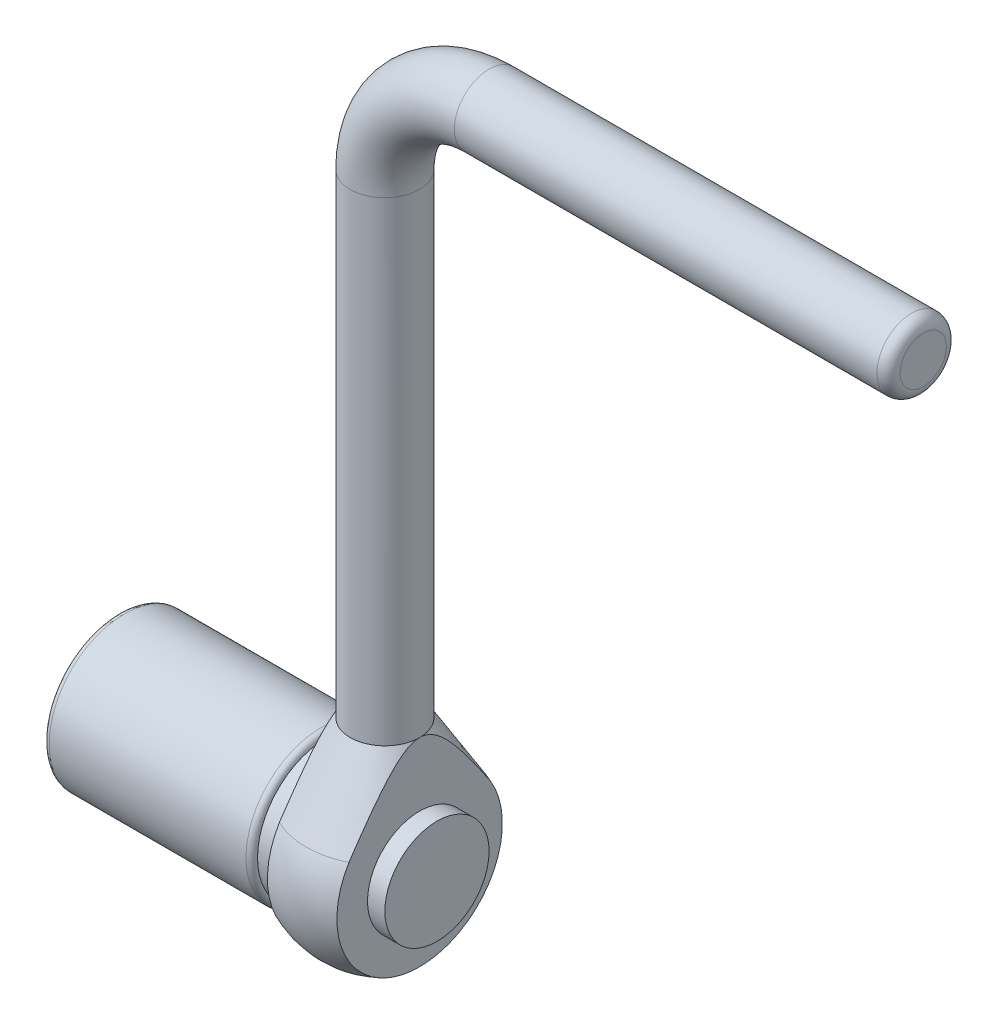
ISO-10303-21;
HEADER;
FILE_DESCRIPTION(('STEP AP214'),'2;1');
FILE_NAME('part.step','',(''),(''),'','','');
FILE_SCHEMA(('AUTOMOTIVE_DESIGN { 1 0 10303 214 1 1 1 1 }'));
ENDSEC;
DATA;
#1=APPLICATION_CONTEXT('core data for automotive mechanical design processes');
#2=APPLICATION_PROTOCOL_DEFINITION('international standard','automotive_design',2000,#1);
#3=PRODUCT_CONTEXT('',#1,'mechanical');
#4=PRODUCT('Part','Part','',(#3));
#5=PRODUCT_RELATED_PRODUCT_CATEGORY('part','',(#4));
#6=PRODUCT_DEFINITION_FORMATION('','',#4);
#7=PRODUCT_DEFINITION_CONTEXT('part definition',#1,'design');
#8=PRODUCT_DEFINITION('design','',#6,#7);
#9=PRODUCT_DEFINITION_SHAPE('','',#8);
#10=(LENGTH_UNIT() NAMED_UNIT(*) SI_UNIT(.MILLI.,.METRE.));
#11=(NAMED_UNIT(*) PLANE_ANGLE_UNIT() SI_UNIT($,.RADIAN.));
#12=(NAMED_UNIT(*) SI_UNIT($,.STERADIAN.) SOLID_ANGLE_UNIT());
#13=UNCERTAINTY_MEASURE_WITH_UNIT(LENGTH_MEASURE(1.E-05),#10,'distance_accuracy_value','');
#14=(GEOMETRIC_REPRESENTATION_CONTEXT(3) GLOBAL_UNCERTAINTY_ASSIGNED_CONTEXT((#13)) GLOBAL_UNIT_ASSIGNED_CONTEXT((#10,
#11,#12)) REPRESENTATION_CONTEXT('',''));
#15=CARTESIAN_POINT('',(0.,0.,0.));
#16=DIRECTION('',(0.,0.,1.));
#17=DIRECTION('',(1.,0.,0.));
#18=AXIS2_PLACEMENT_3D('',#15,#16,#17);
#19=CARTESIAN_POINT('',(72.5,101.,0.));
#20=DIRECTION('',(-1.,0.,0.));
#21=DIRECTION('',(0.,0.,1.));
#22=AXIS2_PLACEMENT_3D('',#19,#20,#21);
#23=PLANE('',#22);
#24=CARTESIAN_POINT('',(72.5,101.,0.));
#25=DIRECTION('',(-1.,0.,0.));
#26=DIRECTION('',(0.,0.,1.));
#27=AXIS2_PLACEMENT_3D('',#24,#25,#26);
#28=CIRCLE('',#27,12.);
#29=CARTESIAN_POINT('',(72.5,101.,12.));
#30=VERTEX_POINT('',#29);
#31=EDGE_CURVE('P0_E295',#30,#30,#28,.T.);
#32=ORIENTED_EDGE('',*,*,#31,.T.);
#33=EDGE_LOOP('',(#32));
#34=FACE_BOUND('',#33,.T.);
#35=DIRECTION('',(0.,0.,-1.));
#36=VECTOR('',#35,1.);
#37=CARTESIAN_POINT('',(72.5,107.5,-6.50000000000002));
#38=LINE('',#37,#36);
#39=CARTESIAN_POINT('',(72.5,107.5,6.49999999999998));
#40=VERTEX_POINT('',#39);
#41=CARTESIAN_POINT('',(72.5,107.5,-6.50000000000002));
#42=VERTEX_POINT('',#41);
#43=EDGE_CURVE('P0_E275',#40,#42,#38,.T.);
#44=ORIENTED_EDGE('',*,*,#43,.F.);
#45=DIRECTION('',(0.,1.,0.));
#46=VECTOR('',#45,1.);
#47=CARTESIAN_POINT('',(72.5,94.5,6.49999999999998));
#48=LINE('',#47,#46);
#49=CARTESIAN_POINT('',(72.5,94.5,6.49999999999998));
#50=VERTEX_POINT('',#49);
#51=EDGE_CURVE('P0_E271',#50,#40,#48,.T.);
#52=ORIENTED_EDGE('',*,*,#51,.F.);
#53=DIRECTION('',(0.,0.,1.));
#54=VECTOR('',#53,1.);
#55=CARTESIAN_POINT('',(72.5,94.5,-6.50000000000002));
#56=LINE('',#55,#54);
#57=CARTESIAN_POINT('',(72.5,94.5,-6.50000000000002));
#58=VERTEX_POINT('',#57);
#59=EDGE_CURVE('P0_E285',#58,#50,#56,.T.);
#60=ORIENTED_EDGE('',*,*,#59,.F.);
#61=DIRECTION('',(0.,-1.,0.));
#62=VECTOR('',#61,1.);
#63=CARTESIAN_POINT('',(72.5,94.5,-6.50000000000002));
#64=LINE('',#63,#62);
#65=EDGE_CURVE('P0_E282',#42,#58,#64,.T.);
#66=ORIENTED_EDGE('',*,*,#65,.F.);
#67=EDGE_LOOP('',(#44,#52,#60,#66));
#68=FACE_BOUND('',#67,.T.);
#69=ADVANCED_FACE('P0_F16',(#34,#68),#23,.T.);
#70=CARTESIAN_POINT('',(76.5,121.,-24.5000000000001));
#71=DIRECTION('',(1.,0.,0.));
#72=DIRECTION('',(0.,0.,-1.));
#73=AXIS2_PLACEMENT_3D('',#70,#71,#72);
#74=PLANE('',#73);
#75=CARTESIAN_POINT('',(76.5,101.,0.));
#76=DIRECTION('',(1.,0.,0.));
#77=DIRECTION('',(0.,0.,-1.));
#78=AXIS2_PLACEMENT_3D('',#75,#76,#77);
#79=CIRCLE('',#78,14.2916059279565);
#80=CARTESIAN_POINT('',(76.5,108.418328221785,-12.2154986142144));
#81=VERTEX_POINT('',#80);
#82=CARTESIAN_POINT('',(76.5,108.418328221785,12.2154986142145));
#83=VERTEX_POINT('',#82);
#84=EDGE_CURVE('P0_E98',#81,#83,#79,.F.);
#85=ORIENTED_EDGE('',*,*,#84,.T.);
#86=CARTESIAN_POINT('',(76.5,97.2277396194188,-19.4743123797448));
#87=CARTESIAN_POINT('',(76.5,97.7949131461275,-19.1153549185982));
#88=CARTESIAN_POINT('',(76.5,98.3617110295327,-18.7558023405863));
#89=CARTESIAN_POINT('',(76.5,99.4943855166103,-18.0352410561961));
#90=CARTESIAN_POINT('',(76.5,100.060262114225,-17.6742323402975));
#91=CARTESIAN_POINT('',(76.5,101.191073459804,-16.9503971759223));
#92=CARTESIAN_POINT('',(76.5,101.756007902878,-16.5875702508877));
#93=CARTESIAN_POINT('',(76.5,102.884539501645,-15.8598446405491));
#94=CARTESIAN_POINT('',(76.5,103.448136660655,-15.4949459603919));
#95=CARTESIAN_POINT('',(76.5,104.573963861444,-14.762442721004));
#96=CARTESIAN_POINT('',(76.5,105.13619309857,-14.3948369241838));
#97=CARTESIAN_POINT('',(76.5,106.258592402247,-13.6564958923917));
#98=CARTESIAN_POINT('',(76.5,106.81876247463,-13.2857606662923));
#99=CARTESIAN_POINT('',(76.5,107.936397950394,-12.5404035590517));
#100=CARTESIAN_POINT('',(76.5,108.49386373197,-12.1657822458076));
#101=CARTESIAN_POINT('',(76.5,109.605356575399,-11.4114821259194));
#102=CARTESIAN_POINT('',(76.5,110.159383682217,-11.0318033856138));
#103=CARTESIAN_POINT('',(76.5,111.262529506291,-10.2660091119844));
#104=CARTESIAN_POINT('',(76.5,111.811650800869,-9.87989730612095));
#105=CARTESIAN_POINT('',(76.5,112.630543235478,-9.29391059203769));
#106=CARTESIAN_POINT('',(76.5,112.902738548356,-9.09742338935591));
#107=CARTESIAN_POINT('',(76.5,113.44517156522,-8.70176420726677));
#108=CARTESIAN_POINT('',(76.5,113.715409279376,-8.5025922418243));
#109=CARTESIAN_POINT('',(76.5,114.254131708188,-8.10058050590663));
#110=CARTESIAN_POINT('',(76.5,114.522610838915,-7.89773324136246));
#111=CARTESIAN_POINT('',(76.5,115.05659538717,-7.48816342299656));
#112=CARTESIAN_POINT('',(76.5,115.322100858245,-7.28144093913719));
#113=CARTESIAN_POINT('',(76.5,115.84926235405,-6.86333090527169));
#114=CARTESIAN_POINT('',(76.5,116.110919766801,-6.65194510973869));
#115=CARTESIAN_POINT('',(76.5,116.629374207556,-6.22330825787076));
#116=CARTESIAN_POINT('',(76.5,116.88617158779,-6.00605762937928));
#117=CARTESIAN_POINT('',(76.5,117.394838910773,-5.56282898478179));
#118=CARTESIAN_POINT('',(76.5,117.646670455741,-5.33680674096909));
#119=CARTESIAN_POINT('',(76.5,118.141568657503,-4.87498207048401));
#120=CARTESIAN_POINT('',(76.5,118.38463042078,-4.63917433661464));
#121=CARTESIAN_POINT('',(76.5,118.739120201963,-4.27644093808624));
#122=CARTESIAN_POINT('',(76.5,118.855398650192,-4.15425499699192));
#123=CARTESIAN_POINT('',(76.5,119.084028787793,-3.90627197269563));
#124=CARTESIAN_POINT('',(76.5,119.196380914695,-3.78047529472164));
#125=CARTESIAN_POINT('',(76.5,119.416164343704,-3.52484186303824));
#126=CARTESIAN_POINT('',(76.5,119.523600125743,-3.3950089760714));
#127=CARTESIAN_POINT('',(76.5,119.732449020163,-3.13060823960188));
#128=CARTESIAN_POINT('',(76.5,119.833863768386,-2.99604169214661));
#129=CARTESIAN_POINT('',(76.5,120.008071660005,-2.7510848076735));
#130=CARTESIAN_POINT('',(76.5,120.082322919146,-2.64173405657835));
#131=CARTESIAN_POINT('',(76.5,120.225193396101,-2.41938062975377));
#132=CARTESIAN_POINT('',(76.5,120.293812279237,-2.30637773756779));
#133=CARTESIAN_POINT('',(76.5,120.424196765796,-2.07651912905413));
#134=CARTESIAN_POINT('',(76.5,120.485965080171,-1.95966496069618));
#135=CARTESIAN_POINT('',(76.5,120.601251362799,-1.72193553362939));
#136=CARTESIAN_POINT('',(76.5,120.654770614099,-1.60106090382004));
#137=CARTESIAN_POINT('',(76.5,120.744756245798,-1.37354994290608));
#138=CARTESIAN_POINT('',(76.5,120.782573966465,-1.26745047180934));
#139=CARTESIAN_POINT('',(76.5,120.84998114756,-1.05267779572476));
#140=CARTESIAN_POINT('',(76.5,120.879573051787,-0.944005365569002));
#141=CARTESIAN_POINT('',(76.5,120.929512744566,-0.724684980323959));
#142=CARTESIAN_POINT('',(76.5,120.949872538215,-0.6140397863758));
#143=CARTESIAN_POINT('',(76.5,120.980610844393,-0.39136004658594));
#144=CARTESIAN_POINT('',(76.5,120.990989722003,-0.279325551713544));
#145=CARTESIAN_POINT('',(76.5,121.00134982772,-0.0541654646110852));
#146=CARTESIAN_POINT('',(76.5,121.001274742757,0.0589627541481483));
#147=CARTESIAN_POINT('',(76.5,120.99058979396,0.284713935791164));
#148=CARTESIAN_POINT('',(76.5,120.979979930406,0.397336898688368));
#149=CARTESIAN_POINT('',(76.5,120.948676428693,0.621212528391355));
#150=CARTESIAN_POINT('',(76.5,120.927978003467,0.732464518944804));
#151=CARTESIAN_POINT('',(76.5,120.877309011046,0.952825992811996));
#152=CARTESIAN_POINT('',(76.5,120.847336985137,1.06193513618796));
#153=CARTESIAN_POINT('',(76.5,120.766741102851,1.31666970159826));
#154=CARTESIAN_POINT('',(76.5,120.712570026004,1.46117294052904));
#155=CARTESIAN_POINT('',(76.5,120.591558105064,1.74475675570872));
#156=CARTESIAN_POINT('',(76.5,120.524711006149,1.8838346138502));
#157=CARTESIAN_POINT('',(76.5,120.380551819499,2.15707198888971));
#158=CARTESIAN_POINT('',(76.5,120.30320139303,2.29121108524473));
#159=CARTESIAN_POINT('',(76.5,120.140308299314,2.55432943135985));
#160=CARTESIAN_POINT('',(76.5,120.0547673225,2.68330973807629));
#161=CARTESIAN_POINT('',(76.5,119.831382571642,3.00188132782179));
#162=CARTESIAN_POINT('',(76.5,119.689287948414,3.18848353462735));
#163=CARTESIAN_POINT('',(76.5,119.394172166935,3.55289874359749));
#164=CARTESIAN_POINT('',(76.5,119.241144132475,3.73070609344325));
#165=CARTESIAN_POINT('',(76.5,118.926676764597,4.07938202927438));
#166=CARTESIAN_POINT('',(76.5,118.765219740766,4.25023456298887));
#167=CARTESIAN_POINT('',(76.5,118.436197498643,4.58583986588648));
#168=CARTESIAN_POINT('',(76.5,118.268633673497,4.75059400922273));
#169=CARTESIAN_POINT('',(76.5,117.926660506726,5.07706299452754));
#170=CARTESIAN_POINT('',(76.5,117.752192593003,5.23871624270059));
#171=CARTESIAN_POINT('',(76.5,117.399385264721,5.55774406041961));
#172=CARTESIAN_POINT('',(76.5,117.221045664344,5.71511842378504));
#173=CARTESIAN_POINT('',(76.5,116.861511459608,6.02604242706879));
#174=CARTESIAN_POINT('',(76.5,116.680321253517,6.17959716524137));
#175=CARTESIAN_POINT('',(76.5,116.315411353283,6.48364944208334));
#176=CARTESIAN_POINT('',(76.5,116.131691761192,6.63414710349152));
#177=CARTESIAN_POINT('',(76.5,115.71753316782,6.96856315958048));
#178=CARTESIAN_POINT('',(76.5,115.486525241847,7.15177635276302));
#179=CARTESIAN_POINT('',(76.5,115.021892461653,7.51485771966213));
#180=CARTESIAN_POINT('',(76.5,114.788267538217,7.69472580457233));
#181=CARTESIAN_POINT('',(76.5,114.084153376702,8.23016729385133));
#182=CARTESIAN_POINT('',(76.5,113.610470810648,8.58154113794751));
#183=CARTESIAN_POINT('',(76.5,112.657015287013,9.2762793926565));
#184=CARTESIAN_POINT('',(76.5,112.177239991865,9.61964057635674));
#185=CARTESIAN_POINT('',(76.5,111.213343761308,10.3002204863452));
#186=CARTESIAN_POINT('',(76.5,110.729222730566,10.6374390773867));
#187=CARTESIAN_POINT('',(76.5,109.756675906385,11.3078399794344));
#188=CARTESIAN_POINT('',(76.5,109.268243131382,11.6410121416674));
#189=CARTESIAN_POINT('',(76.5,108.288826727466,12.3035946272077));
#190=CARTESIAN_POINT('',(76.5,107.797843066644,12.6330049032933));
#191=CARTESIAN_POINT('',(76.5,106.813984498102,13.2887177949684));
#192=CARTESIAN_POINT('',(76.5,106.32111009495,13.6150211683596));
#193=CARTESIAN_POINT('',(76.5,105.33373454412,14.2651570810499));
#194=CARTESIAN_POINT('',(76.5,104.839233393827,14.5889896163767));
#195=CARTESIAN_POINT('',(76.5,103.463632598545,15.4857962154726));
#196=CARTESIAN_POINT('',(76.5,102.581100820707,16.056573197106));
#197=CARTESIAN_POINT('',(76.5,100.812953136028,17.1934664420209));
#198=CARTESIAN_POINT('',(76.5,99.927337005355,17.7595823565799));
#199=CARTESIAN_POINT('',(76.5,98.1570625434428,18.8861947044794));
#200=CARTESIAN_POINT('',(76.5,97.2724124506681,19.4467040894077));
#201=CARTESIAN_POINT('',(76.5,95.9441743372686,20.2853812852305));
#202=CARTESIAN_POINT('',(76.5,95.5012369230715,20.5645805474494));
#203=CARTESIAN_POINT('',(76.5,94.6149756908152,21.1223642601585));
#204=CARTESIAN_POINT('',(76.5,94.1716518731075,21.4009487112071));
#205=CARTESIAN_POINT('',(76.5,93.7281580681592,21.6792623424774));
#206=B_SPLINE_CURVE_WITH_KNOTS('',3,(#86,#87,#88,#89,#90,#91,#92,#93,#94,#95,#96,#97,#98,#99,
#100,#101,#102,#103,#104,#105,#106,#107,#108,#109,#110,#111,#112,#113,#114,#115,#116,#117,#118,
#119,#120,#121,#122,#123,#124,#125,#126,#127,#128,#129,#130,#131,#132,#133,#134,#135,#136,#137,
#138,#139,#140,#141,#142,#143,#144,#145,#146,#147,#148,#149,#150,#151,#152,#153,#154,#155,#156,
#157,#158,#159,#160,#161,#162,#163,#164,#165,#166,#167,#168,#169,#170,#171,#172,#173,#174,#175,
#176,#177,#178,#179,#180,#181,#182,#183,#184,#185,#186,#187,#188,#189,#190,#191,#192,#193,#194,
#195,#196,#197,#198,#199,#200,#201,#202,#203,#204,#205),.UNSPECIFIED.,.F.,.F.,(4,2,2,2,2,2,2,2,
2,2,2,2,2,2,2,2,2,2,2,2,2,2,2,2,2,2,2,2,2,2,2,2,2,2,2,2,2,2,2,2,2,2,2,2,2,2,2,2,2,2,2,2,2,2,2,2,
2,2,2,4),(0.,2.0136608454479,4.02733487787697,6.04156762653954,8.05579537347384,
10.0710095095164,12.0862179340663,14.1011359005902,16.116027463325,18.129789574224,
19.1368902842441,20.1439857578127,21.1534385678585,22.1628731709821,23.171934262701,
24.1809219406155,25.1959116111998,26.2114591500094,26.7174081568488,27.2233006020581,
27.7287224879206,28.2340064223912,28.6303978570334,29.0268128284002,29.423070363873,
29.8192662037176,30.1568896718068,30.4944127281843,30.8314956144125,31.1685661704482,
31.5074525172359,31.8463388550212,32.1853861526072,32.524486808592,32.9866840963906,
33.4491100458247,33.9132717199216,34.3773378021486,35.0803653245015,35.7838389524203,
36.4888535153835,37.1937082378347,37.9071614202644,38.62064892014,39.3331265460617,
40.0455755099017,40.9300617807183,41.8145714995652,43.5837677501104,45.353664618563,
47.1236004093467,48.8973131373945,50.6710481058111,52.4443387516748,54.217632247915,
57.3706771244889,60.523955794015,63.6657618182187,65.2365294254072,66.8072956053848),.UNSPECIFIED.);
#207=CARTESIAN_POINT('',(76.5,121.,0.));
#208=VERTEX_POINT('',#207);
#209=EDGE_CURVE('P0_E134',#208,#83,#206,.T.);
#210=ORIENTED_EDGE('',*,*,#209,.F.);
#211=EDGE_CURVE('P0_E119',#81,#208,#206,.T.);
#212=ORIENTED_EDGE('',*,*,#211,.F.);
#213=EDGE_LOOP('',(#85,#210,#212));
#214=FACE_BOUND('',#213,.T.);
#215=CARTESIAN_POINT('',(76.5,101.,0.));
#216=DIRECTION('',(1.,0.,0.));
#217=DIRECTION('',(0.,0.,-1.));
#218=AXIS2_PLACEMENT_3D('',#215,#216,#217);
#219=CIRCLE('',#218,12.);
#220=CARTESIAN_POINT('',(76.5,101.,-12.));
#221=VERTEX_POINT('',#220);
#222=EDGE_CURVE('P0_E192',#221,#221,#219,.F.);
#223=ORIENTED_EDGE('',*,*,#222,.F.);
#224=EDGE_LOOP('',(#223));
#225=FACE_BOUND('',#224,.T.);
#226=ADVANCED_FACE('P0_F145',(#214,#225),#74,.F.);
#227=CARTESIAN_POINT('',(88.5,121.,-24.5000000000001));
#228=DIRECTION('',(-1.,0.,0.));
#229=DIRECTION('',(0.,0.,1.));
#230=AXIS2_PLACEMENT_3D('',#227,#228,#229);
#231=PLANE('',#230);
#232=CARTESIAN_POINT('',(88.5,101.,0.));
#233=DIRECTION('',(-1.,0.,0.));
#234=DIRECTION('',(0.,0.,1.));
#235=AXIS2_PLACEMENT_3D('',#232,#233,#234);
#236=CIRCLE('',#235,14.2916059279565);
#237=CARTESIAN_POINT('',(88.5,108.418328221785,12.2154986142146));
#238=VERTEX_POINT('',#237);
#239=CARTESIAN_POINT('',(88.5,108.418328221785,-12.2154986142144));
#240=VERTEX_POINT('',#239);
#241=EDGE_CURVE('P0_E107',#238,#240,#236,.F.);
#242=ORIENTED_EDGE('',*,*,#241,.T.);
#243=CARTESIAN_POINT('',(88.5,97.2277396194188,-19.4743123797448));
#244=CARTESIAN_POINT('',(88.5,97.7949131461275,-19.1153549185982));
#245=CARTESIAN_POINT('',(88.5,98.3617110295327,-18.7558023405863));
#246=CARTESIAN_POINT('',(88.5,99.4943855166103,-18.0352410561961));
#247=CARTESIAN_POINT('',(88.5,100.060262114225,-17.6742323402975));
#248=CARTESIAN_POINT('',(88.5,101.191073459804,-16.9503971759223));
#249=CARTESIAN_POINT('',(88.5,101.756007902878,-16.5875702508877));
#250=CARTESIAN_POINT('',(88.5,102.884539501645,-15.8598446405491));
#251=CARTESIAN_POINT('',(88.5,103.448136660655,-15.4949459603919));
#252=CARTESIAN_POINT('',(88.5,104.573963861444,-14.762442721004));
#253=CARTESIAN_POINT('',(88.5,105.13619309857,-14.3948369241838));
#254=CARTESIAN_POINT('',(88.5,106.258592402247,-13.6564958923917));
#255=CARTESIAN_POINT('',(88.5,106.81876247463,-13.2857606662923));
#256=CARTESIAN_POINT('',(88.5,107.936397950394,-12.5404035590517));
#257=CARTESIAN_POINT('',(88.5,108.49386373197,-12.1657822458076));
#258=CARTESIAN_POINT('',(88.5,109.605356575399,-11.4114821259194));
#259=CARTESIAN_POINT('',(88.5,110.159383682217,-11.0318033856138));
#260=CARTESIAN_POINT('',(88.5,111.262529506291,-10.2660091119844));
#261=CARTESIAN_POINT('',(88.5,111.811650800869,-9.87989730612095));
#262=CARTESIAN_POINT('',(88.5,112.630543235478,-9.29391059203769));
#263=CARTESIAN_POINT('',(88.5,112.902738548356,-9.09742338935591));
#264=CARTESIAN_POINT('',(88.5,113.44517156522,-8.70176420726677));
#265=CARTESIAN_POINT('',(88.5,113.715409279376,-8.5025922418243));
#266=CARTESIAN_POINT('',(88.5,114.254131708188,-8.10058050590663));
#267=CARTESIAN_POINT('',(88.5,114.522610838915,-7.89773324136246));
#268=CARTESIAN_POINT('',(88.5,115.05659538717,-7.48816342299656));
#269=CARTESIAN_POINT('',(88.5,115.322100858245,-7.28144093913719));
#270=CARTESIAN_POINT('',(88.5,115.84926235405,-6.86333090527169));
#271=CARTESIAN_POINT('',(88.5,116.110919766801,-6.65194510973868));
#272=CARTESIAN_POINT('',(88.5,116.629374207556,-6.22330825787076));
#273=CARTESIAN_POINT('',(88.5,116.88617158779,-6.00605762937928));
#274=CARTESIAN_POINT('',(88.5,117.394838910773,-5.56282898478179));
#275=CARTESIAN_POINT('',(88.5,117.646670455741,-5.33680674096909));
#276=CARTESIAN_POINT('',(88.5,118.141568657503,-4.87498207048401));
#277=CARTESIAN_POINT('',(88.5,118.38463042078,-4.63917433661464));
#278=CARTESIAN_POINT('',(88.5,118.739120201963,-4.27644093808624));
#279=CARTESIAN_POINT('',(88.5,118.855398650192,-4.15425499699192));
#280=CARTESIAN_POINT('',(88.5,119.084028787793,-3.90627197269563));
#281=CARTESIAN_POINT('',(88.5,119.196380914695,-3.78047529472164));
#282=CARTESIAN_POINT('',(88.5,119.416164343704,-3.52484186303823));
#283=CARTESIAN_POINT('',(88.5,119.523600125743,-3.39500897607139));
#284=CARTESIAN_POINT('',(88.5,119.732449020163,-3.13060823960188));
#285=CARTESIAN_POINT('',(88.5,119.833863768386,-2.99604169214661));
#286=CARTESIAN_POINT('',(88.5,120.008071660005,-2.7510848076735));
#287=CARTESIAN_POINT('',(88.5,120.082322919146,-2.64173405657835));
#288=CARTESIAN_POINT('',(88.5,120.225193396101,-2.41938062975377));
#289=CARTESIAN_POINT('',(88.5,120.293812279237,-2.30637773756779));
#290=CARTESIAN_POINT('',(88.5,120.424196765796,-2.07651912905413));
#291=CARTESIAN_POINT('',(88.5,120.485965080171,-1.95966496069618));
#292=CARTESIAN_POINT('',(88.5,120.601251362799,-1.72193553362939));
#293=CARTESIAN_POINT('',(88.5,120.654770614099,-1.60106090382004));
#294=CARTESIAN_POINT('',(88.5,120.744756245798,-1.37354994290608));
#295=CARTESIAN_POINT('',(88.5,120.782573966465,-1.26745047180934));
#296=CARTESIAN_POINT('',(88.5,120.84998114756,-1.05267779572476));
#297=CARTESIAN_POINT('',(88.5,120.879573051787,-0.944005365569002));
#298=CARTESIAN_POINT('',(88.5,120.929512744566,-0.724684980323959));
#299=CARTESIAN_POINT('',(88.5,120.949872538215,-0.6140397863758));
#300=CARTESIAN_POINT('',(88.5,120.980610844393,-0.39136004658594));
#301=CARTESIAN_POINT('',(88.5,120.990989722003,-0.279325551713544));
#302=CARTESIAN_POINT('',(88.5,121.00134982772,-0.0541654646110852));
#303=CARTESIAN_POINT('',(88.5,121.001274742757,0.0589627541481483));
#304=CARTESIAN_POINT('',(88.5,120.99058979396,0.284713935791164));
#305=CARTESIAN_POINT('',(88.5,120.979979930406,0.397336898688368));
#306=CARTESIAN_POINT('',(88.5,120.948676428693,0.621212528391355));
#307=CARTESIAN_POINT('',(88.5,120.927978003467,0.732464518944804));
#308=CARTESIAN_POINT('',(88.5,120.877309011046,0.952825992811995));
#309=CARTESIAN_POINT('',(88.5,120.847336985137,1.06193513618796));
#310=CARTESIAN_POINT('',(88.5,120.766741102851,1.31666970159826));
#311=CARTESIAN_POINT('',(88.5,120.712570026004,1.46117294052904));
#312=CARTESIAN_POINT('',(88.5,120.591558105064,1.74475675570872));
#313=CARTESIAN_POINT('',(88.5,120.524711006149,1.8838346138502));
#314=CARTESIAN_POINT('',(88.5,120.380551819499,2.15707198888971));
#315=CARTESIAN_POINT('',(88.5,120.30320139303,2.29121108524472));
#316=CARTESIAN_POINT('',(88.5,120.140308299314,2.55432943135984));
#317=CARTESIAN_POINT('',(88.5,120.0547673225,2.68330973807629));
#318=CARTESIAN_POINT('',(88.5,119.831382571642,3.00188132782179));
#319=CARTESIAN_POINT('',(88.5,119.689287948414,3.18848353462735));
#320=CARTESIAN_POINT('',(88.5,119.394172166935,3.55289874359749));
#321=CARTESIAN_POINT('',(88.5,119.241144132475,3.73070609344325));
#322=CARTESIAN_POINT('',(88.5,118.926676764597,4.07938202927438));
#323=CARTESIAN_POINT('',(88.5,118.765219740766,4.25023456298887));
#324=CARTESIAN_POINT('',(88.5,118.436197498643,4.58583986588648));
#325=CARTESIAN_POINT('',(88.5,118.268633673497,4.75059400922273));
#326=CARTESIAN_POINT('',(88.5,117.926660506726,5.07706299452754));
#327=CARTESIAN_POINT('',(88.5,117.752192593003,5.23871624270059));
#328=CARTESIAN_POINT('',(88.5,117.399385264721,5.55774406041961));
#329=CARTESIAN_POINT('',(88.5,117.221045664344,5.71511842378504));
#330=CARTESIAN_POINT('',(88.5,116.861511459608,6.02604242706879));
#331=CARTESIAN_POINT('',(88.5,116.680321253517,6.17959716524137));
#332=CARTESIAN_POINT('',(88.5,116.315411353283,6.48364944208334));
#333=CARTESIAN_POINT('',(88.5,116.131691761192,6.63414710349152));
#334=CARTESIAN_POINT('',(88.5,115.71753316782,6.96856315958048));
#335=CARTESIAN_POINT('',(88.5,115.486525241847,7.15177635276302));
#336=CARTESIAN_POINT('',(88.5,115.021892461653,7.51485771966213));
#337=CARTESIAN_POINT('',(88.5,114.788267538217,7.69472580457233));
#338=CARTESIAN_POINT('',(88.5,114.084153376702,8.23016729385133));
#339=CARTESIAN_POINT('',(88.5,113.610470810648,8.58154113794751));
#340=CARTESIAN_POINT('',(88.5,112.657015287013,9.2762793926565));
#341=CARTESIAN_POINT('',(88.5,112.177239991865,9.61964057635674));
#342=CARTESIAN_POINT('',(88.5,111.213343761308,10.3002204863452));
#343=CARTESIAN_POINT('',(88.5,110.729222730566,10.6374390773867));
#344=CARTESIAN_POINT('',(88.5,109.756675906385,11.3078399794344));
#345=CARTESIAN_POINT('',(88.5,109.268243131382,11.6410121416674));
#346=CARTESIAN_POINT('',(88.5,108.288826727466,12.3035946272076));
#347=CARTESIAN_POINT('',(88.5,107.797843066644,12.6330049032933));
#348=CARTESIAN_POINT('',(88.5,106.813984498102,13.2887177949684));
#349=CARTESIAN_POINT('',(88.5,106.32111009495,13.6150211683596));
#350=CARTESIAN_POINT('',(88.5,105.33373454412,14.2651570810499));
#351=CARTESIAN_POINT('',(88.5,104.839233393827,14.5889896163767));
#352=CARTESIAN_POINT('',(88.5,103.463632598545,15.4857962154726));
#353=CARTESIAN_POINT('',(88.5,102.581100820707,16.056573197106));
#354=CARTESIAN_POINT('',(88.5,100.812953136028,17.1934664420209));
#355=CARTESIAN_POINT('',(88.5,99.9273370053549,17.7595823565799));
#356=CARTESIAN_POINT('',(88.5,98.1570625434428,18.8861947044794));
#357=CARTESIAN_POINT('',(88.5,97.2724124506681,19.4467040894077));
#358=CARTESIAN_POINT('',(88.5,95.9441743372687,20.2853812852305));
#359=CARTESIAN_POINT('',(88.5,95.5012369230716,20.5645805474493));
#360=CARTESIAN_POINT('',(88.5,94.6149756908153,21.1223642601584));
#361=CARTESIAN_POINT('',(88.5,94.1716518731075,21.4009487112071));
#362=CARTESIAN_POINT('',(88.5,93.7281580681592,21.6792623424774));
#363=B_SPLINE_CURVE_WITH_KNOTS('',3,(#243,#244,#245,#246,#247,#248,#249,#250,#251,#252,#253,
#254,#255,#256,#257,#258,#259,#260,#261,#262,#263,#264,#265,#266,#267,#268,#269,#270,#271,#272,
#273,#274,#275,#276,#277,#278,#279,#280,#281,#282,#283,#284,#285,#286,#287,#288,#289,#290,#291,
#292,#293,#294,#295,#296,#297,#298,#299,#300,#301,#302,#303,#304,#305,#306,#307,#308,#309,#310,
#311,#312,#313,#314,#315,#316,#317,#318,#319,#320,#321,#322,#323,#324,#325,#326,#327,#328,#329,
#330,#331,#332,#333,#334,#335,#336,#337,#338,#339,#340,#341,#342,#343,#344,#345,#346,#347,#348,
#349,#350,#351,#352,#353,#354,#355,#356,#357,#358,#359,#360,#361,#362),.UNSPECIFIED.,.F.,.F.,(4,
2,2,2,2,2,2,2,2,2,2,2,2,2,2,2,2,2,2,2,2,2,2,2,2,2,2,2,2,2,2,2,2,2,2,2,2,2,2,2,2,2,2,2,2,2,2,2,2,
2,2,2,2,2,2,2,2,2,2,4),(0.,2.0136608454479,4.02733487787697,6.04156762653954,8.05579537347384,
10.0710095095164,12.0862179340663,14.1011359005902,16.116027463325,18.129789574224,
19.1368902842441,20.1439857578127,21.1534385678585,22.1628731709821,23.171934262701,
24.1809219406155,25.1959116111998,26.2114591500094,26.7174081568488,27.2233006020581,
27.7287224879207,28.2340064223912,28.6303978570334,29.0268128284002,29.423070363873,
29.8192662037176,30.1568896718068,30.4944127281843,30.8314956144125,31.1685661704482,
31.5074525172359,31.8463388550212,32.1853861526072,32.524486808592,32.9866840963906,
33.4491100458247,33.9132717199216,34.3773378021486,35.0803653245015,35.7838389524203,
36.4888535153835,37.1937082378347,37.9071614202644,38.62064892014,39.3331265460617,
40.0455755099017,40.9300617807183,41.8145714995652,43.5837677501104,45.353664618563,
47.1236004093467,48.8973131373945,50.6710481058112,52.4443387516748,54.217632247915,
57.3706771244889,60.523955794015,63.6657618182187,65.2365294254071,66.8072956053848),.UNSPECIFIED.);
#364=CARTESIAN_POINT('',(88.5,121.,0.));
#365=VERTEX_POINT('',#364);
#366=EDGE_CURVE('P0_E102',#365,#240,#363,.F.);
#367=ORIENTED_EDGE('',*,*,#366,.F.);
#368=EDGE_CURVE('P0_E105',#238,#365,#363,.F.);
#369=ORIENTED_EDGE('',*,*,#368,.F.);
#370=EDGE_LOOP('',(#242,#367,#369));
#371=FACE_BOUND('',#370,.T.);
#372=CARTESIAN_POINT('',(88.5,101.,0.));
#373=DIRECTION('',(-1.,0.,0.));
#374=DIRECTION('',(0.,0.,1.));
#375=AXIS2_PLACEMENT_3D('',#372,#373,#374);
#376=CIRCLE('',#375,9.);
#377=CARTESIAN_POINT('',(88.5,101.,8.99999999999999));
#378=VERTEX_POINT('',#377);
#379=EDGE_CURVE('P0_E194',#378,#378,#376,.F.);
#380=ORIENTED_EDGE('',*,*,#379,.F.);
#381=EDGE_LOOP('',(#380));
#382=FACE_BOUND('',#381,.T.);
#383=ADVANCED_FACE('P0_F103',(#371,#382),#231,.F.);
#384=CARTESIAN_POINT('',(82.5,121.,0.));
#385=DIRECTION('',(0.,-1.,0.));
#386=DIRECTION('',(0.,0.,-1.));
#387=AXIS2_PLACEMENT_3D('',#384,#385,#386);
#388=CONICAL_SURFACE('',#387,6.,0.543947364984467);
#389=CARTESIAN_POINT('',(82.5,108.418328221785,0.));
#390=DIRECTION('',(0.,-1.,0.));
#391=DIRECTION('',(0.,0.,-1.));
#392=AXIS2_PLACEMENT_3D('',#389,#390,#391);
#393=CIRCLE('',#392,13.6094969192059);
#394=EDGE_CURVE('P0_E115',#238,#83,#393,.T.);
#395=ORIENTED_EDGE('',*,*,#394,.F.);
#396=ORIENTED_EDGE('',*,*,#368,.T.);
#397=CARTESIAN_POINT('',(82.5,121.,0.));
#398=DIRECTION('',(0.,-1.,0.));
#399=DIRECTION('',(0.,0.,-1.));
#400=AXIS2_PLACEMENT_3D('',#397,#398,#399);
#401=CIRCLE('',#400,6.);
#402=EDGE_CURVE('P0_E89',#365,#208,#401,.T.);
#403=ORIENTED_EDGE('',*,*,#402,.T.);
#404=ORIENTED_EDGE('',*,*,#209,.T.);
#405=EDGE_LOOP('',(#395,#396,#403,#404));
#406=FACE_BOUND('',#405,.T.);
#407=ADVANCED_FACE('P0_F114',(#406),#388,.T.);
#408=CARTESIAN_POINT('',(82.5,101.,0.));
#409=DIRECTION('',(0.,-1.,0.));
#410=DIRECTION('',(0.,0.,1.));
#411=AXIS2_PLACEMENT_3D('',#408,#409,#410);
#412=SPHERICAL_SURFACE('',#411,15.5);
#413=ORIENTED_EDGE('',*,*,#241,.F.);
#414=ORIENTED_EDGE('',*,*,#394,.T.);
#415=ORIENTED_EDGE('',*,*,#84,.F.);
#416=EDGE_CURVE('P0_E121',#81,#240,#393,.T.);
#417=ORIENTED_EDGE('',*,*,#416,.T.);
#418=EDGE_LOOP('',(#413,#414,#415,#417));
#419=FACE_BOUND('',#418,.T.);
#420=ADVANCED_FACE('P0_F200',(#419),#412,.T.);
#421=EDGE_CURVE('P0_E93',#208,#365,#401,.T.);
#422=ORIENTED_EDGE('',*,*,#421,.T.);
#423=ORIENTED_EDGE('',*,*,#366,.T.);
#424=ORIENTED_EDGE('',*,*,#416,.F.);
#425=ORIENTED_EDGE('',*,*,#211,.T.);
#426=EDGE_LOOP('',(#422,#423,#424,#425));
#427=FACE_BOUND('',#426,.T.);
#428=ADVANCED_FACE('P0_F118',(#427),#388,.T.);
#429=CARTESIAN_POINT('',(91.5000000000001,101.,0.));
#430=DIRECTION('',(-1.,0.,0.));
#431=DIRECTION('',(0.,0.,1.));
#432=AXIS2_PLACEMENT_3D('',#429,#430,#431);
#433=CYLINDRICAL_SURFACE('',#432,9.);
#434=CARTESIAN_POINT('',(91.5000000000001,101.,0.));
#435=DIRECTION('',(1.,0.,0.));
#436=DIRECTION('',(0.,0.,-1.));
#437=AXIS2_PLACEMENT_3D('',#434,#435,#436);
#438=CIRCLE('',#437,9.);
#439=CARTESIAN_POINT('',(91.5000000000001,101.,-9.00000000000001));
#440=VERTEX_POINT('',#439);
#441=EDGE_CURVE('P0_E111',#440,#440,#438,.T.);
#442=ORIENTED_EDGE('',*,*,#441,.F.);
#443=EDGE_LOOP('',(#442));
#444=FACE_BOUND('',#443,.T.);
#445=ORIENTED_EDGE('',*,*,#379,.T.);
#446=EDGE_LOOP('',(#445));
#447=FACE_BOUND('',#446,.T.);
#448=ADVANCED_FACE('P0_F153',(#444,#447),#433,.T.);
#449=CARTESIAN_POINT('',(91.5000000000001,101.,0.));
#450=DIRECTION('',(1.,0.,0.));
#451=DIRECTION('',(0.,0.,-1.));
#452=AXIS2_PLACEMENT_3D('',#449,#450,#451);
#453=PLANE('',#452);
#454=ORIENTED_EDGE('',*,*,#441,.T.);
#455=EDGE_LOOP('',(#454));
#456=FACE_BOUND('',#455,.T.);
#457=ADVANCED_FACE('P0_F208',(#456),#453,.T.);
#458=CARTESIAN_POINT('',(72.5,101.,0.));
#459=DIRECTION('',(1.,0.,0.));
#460=DIRECTION('',(0.,0.,-1.));
#461=AXIS2_PLACEMENT_3D('',#458,#459,#460);
#462=CYLINDRICAL_SURFACE('',#461,12.);
#463=ORIENTED_EDGE('',*,*,#31,.F.);
#464=EDGE_LOOP('',(#463));
#465=FACE_BOUND('',#464,.T.);
#466=ORIENTED_EDGE('',*,*,#222,.T.);
#467=EDGE_LOOP('',(#466));
#468=FACE_BOUND('',#467,.T.);
#469=ADVANCED_FACE('P0_F205',(#465,#468),#462,.T.);
#470=CARTESIAN_POINT('',(55.5000000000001,94.5,6.49999999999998));
#471=DIRECTION('',(0.,0.,-1.));
#472=DIRECTION('',(-1.,0.,0.));
#473=AXIS2_PLACEMENT_3D('',#470,#471,#472);
#474=PLANE('',#473);
#475=DIRECTION('',(1.,0.,0.));
#476=VECTOR('',#475,1.);
#477=CARTESIAN_POINT('',(55.5000000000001,107.5,6.49999999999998));
#478=LINE('',#477,#476);
#479=CARTESIAN_POINT('',(56.5,107.5,6.49999999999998));
#480=VERTEX_POINT('',#479);
#481=EDGE_CURVE('P0_E294',#480,#40,#478,.T.);
#482=ORIENTED_EDGE('',*,*,#481,.F.);
#483=DIRECTION('',(0.,-1.,0.));
#484=VECTOR('',#483,1.);
#485=CARTESIAN_POINT('',(56.5,94.5,6.49999999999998));
#486=LINE('',#485,#484);
#487=CARTESIAN_POINT('',(56.5,94.5,6.49999999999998));
#488=VERTEX_POINT('',#487);
#489=EDGE_CURVE('P0_E179',#480,#488,#486,.T.);
#490=ORIENTED_EDGE('',*,*,#489,.T.);
#491=DIRECTION('',(1.,0.,0.));
#492=VECTOR('',#491,1.);
#493=CARTESIAN_POINT('',(55.5000000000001,94.5,6.49999999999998));
#494=LINE('',#493,#492);
#495=EDGE_CURVE('P0_E288',#488,#50,#494,.T.);
#496=ORIENTED_EDGE('',*,*,#495,.T.);
#497=ORIENTED_EDGE('',*,*,#51,.T.);
#498=EDGE_LOOP('',(#482,#490,#496,#497));
#499=FACE_BOUND('',#498,.T.);
#500=ADVANCED_FACE('P0_F207',(#499),#474,.F.);
#501=CARTESIAN_POINT('',(55.5000000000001,107.5,-6.50000000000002));
#502=DIRECTION('',(0.,-1.,0.));
#503=DIRECTION('',(0.,0.,-1.));
#504=AXIS2_PLACEMENT_3D('',#501,#502,#503);
#505=PLANE('',#504);
#506=DIRECTION('',(1.,0.,0.));
#507=VECTOR('',#506,1.);
#508=CARTESIAN_POINT('',(55.5000000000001,107.5,-6.50000000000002));
#509=LINE('',#508,#507);
#510=CARTESIAN_POINT('',(56.5,107.5,-6.50000000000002));
#511=VERTEX_POINT('',#510);
#512=EDGE_CURVE('P0_E292',#511,#42,#509,.T.);
#513=ORIENTED_EDGE('',*,*,#512,.F.);
#514=DIRECTION('',(0.,0.,1.));
#515=VECTOR('',#514,1.);
#516=CARTESIAN_POINT('',(56.5,107.5,-6.50000000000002));
#517=LINE('',#516,#515);
#518=EDGE_CURVE('P0_E186',#511,#480,#517,.T.);
#519=ORIENTED_EDGE('',*,*,#518,.T.);
#520=ORIENTED_EDGE('',*,*,#481,.T.);
#521=ORIENTED_EDGE('',*,*,#43,.T.);
#522=EDGE_LOOP('',(#513,#519,#520,#521));
#523=FACE_BOUND('',#522,.T.);
#524=ADVANCED_FACE('P0_F216',(#523),#505,.F.);
#525=CARTESIAN_POINT('',(55.5000000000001,94.5,-6.50000000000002));
#526=DIRECTION('',(0.,0.,1.));
#527=DIRECTION('',(1.,0.,0.));
#528=AXIS2_PLACEMENT_3D('',#525,#526,#527);
#529=PLANE('',#528);
#530=DIRECTION('',(1.,0.,0.));
#531=VECTOR('',#530,1.);
#532=CARTESIAN_POINT('',(55.5000000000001,94.5,-6.50000000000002));
#533=LINE('',#532,#531);
#534=CARTESIAN_POINT('',(56.5,94.5,-6.50000000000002));
#535=VERTEX_POINT('',#534);
#536=EDGE_CURVE('P0_E290',#535,#58,#533,.T.);
#537=ORIENTED_EDGE('',*,*,#536,.F.);
#538=DIRECTION('',(0.,1.,0.));
#539=VECTOR('',#538,1.);
#540=CARTESIAN_POINT('',(56.5,94.5,-6.50000000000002));
#541=LINE('',#540,#539);
#542=EDGE_CURVE('P0_E175',#535,#511,#541,.T.);
#543=ORIENTED_EDGE('',*,*,#542,.T.);
#544=ORIENTED_EDGE('',*,*,#512,.T.);
#545=ORIENTED_EDGE('',*,*,#65,.T.);
#546=EDGE_LOOP('',(#537,#543,#544,#545));
#547=FACE_BOUND('',#546,.T.);
#548=ADVANCED_FACE('P0_F231',(#547),#529,.F.);
#549=CARTESIAN_POINT('',(55.5000000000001,94.5,-6.50000000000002));
#550=DIRECTION('',(0.,1.,0.));
#551=DIRECTION('',(0.,0.,1.));
#552=AXIS2_PLACEMENT_3D('',#549,#550,#551);
#553=PLANE('',#552);
#554=ORIENTED_EDGE('',*,*,#495,.F.);
#555=DIRECTION('',(0.,0.,-1.));
#556=VECTOR('',#555,1.);
#557=CARTESIAN_POINT('',(56.5,94.5,-6.50000000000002));
#558=LINE('',#557,#556);
#559=EDGE_CURVE('P0_E165',#488,#535,#558,.T.);
#560=ORIENTED_EDGE('',*,*,#559,.T.);
#561=ORIENTED_EDGE('',*,*,#536,.T.);
#562=ORIENTED_EDGE('',*,*,#59,.T.);
#563=EDGE_LOOP('',(#554,#560,#561,#562));
#564=FACE_BOUND('',#563,.T.);
#565=ADVANCED_FACE('P0_F235',(#564),#553,.F.);
#566=CARTESIAN_POINT('',(55.5000000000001,101.,0.));
#567=DIRECTION('',(1.,0.,0.));
#568=DIRECTION('',(0.,0.,-1.));
#569=AXIS2_PLACEMENT_3D('',#566,#567,#568);
#570=PLANE('',#569);
#571=DIRECTION('',(0.,-1.,0.));
#572=VECTOR('',#571,1.);
#573=CARTESIAN_POINT('',(55.5000000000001,101.,-5.50000000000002));
#574=LINE('',#573,#572);
#575=CARTESIAN_POINT('',(55.5000000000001,106.5,-5.50000000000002));
#576=VERTEX_POINT('',#575);
#577=CARTESIAN_POINT('',(55.5000000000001,95.5,-5.50000000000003));
#578=VERTEX_POINT('',#577);
#579=EDGE_CURVE('P0_E177',#576,#578,#574,.T.);
#580=ORIENTED_EDGE('',*,*,#579,.T.);
#581=DIRECTION('',(0.,0.,1.));
#582=VECTOR('',#581,1.);
#583=CARTESIAN_POINT('',(55.5000000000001,95.5,0.));
#584=LINE('',#583,#582);
#585=CARTESIAN_POINT('',(55.5000000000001,95.5,5.49999999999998));
#586=VERTEX_POINT('',#585);
#587=EDGE_CURVE('P0_E169',#578,#586,#584,.T.);
#588=ORIENTED_EDGE('',*,*,#587,.T.);
#589=DIRECTION('',(0.,1.,0.));
#590=VECTOR('',#589,1.);
#591=CARTESIAN_POINT('',(55.5000000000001,101.,5.49999999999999));
#592=LINE('',#591,#590);
#593=CARTESIAN_POINT('',(55.5000000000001,106.5,5.49999999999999));
#594=VERTEX_POINT('',#593);
#595=EDGE_CURVE('P0_E184',#586,#594,#592,.T.);
#596=ORIENTED_EDGE('',*,*,#595,.T.);
#597=DIRECTION('',(0.,0.,-1.));
#598=VECTOR('',#597,1.);
#599=CARTESIAN_POINT('',(55.5000000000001,106.5,0.));
#600=LINE('',#599,#598);
#601=EDGE_CURVE('P0_E189',#594,#576,#600,.T.);
#602=ORIENTED_EDGE('',*,*,#601,.T.);
#603=EDGE_LOOP('',(#580,#588,#596,#602));
#604=FACE_BOUND('',#603,.T.);
#605=ADVANCED_FACE('P0_F239',(#604),#570,.F.);
#606=CARTESIAN_POINT('',(55.5000000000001,106.5,0.));
#607=DIRECTION('',(0.707106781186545,-0.70710678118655,0.));
#608=DIRECTION('',(0.,0.,-1.));
#609=AXIS2_PLACEMENT_3D('',#606,#607,#608);
#610=PLANE('',#609);
#611=ORIENTED_EDGE('',*,*,#518,.F.);
#612=DIRECTION('',(-0.577350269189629,-0.577350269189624,0.577350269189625));
#613=VECTOR('',#612,1.);
#614=CARTESIAN_POINT('',(53.6666666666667,104.666666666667,-3.6666666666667));
#615=LINE('',#614,#613);
#616=EDGE_CURVE('P0_E173',#511,#576,#615,.T.);
#617=ORIENTED_EDGE('',*,*,#616,.T.);
#618=ORIENTED_EDGE('',*,*,#601,.F.);
#619=DIRECTION('',(0.577350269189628,0.577350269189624,0.577350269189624));
#620=VECTOR('',#619,1.);
#621=CARTESIAN_POINT('',(53.6666666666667,104.666666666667,3.66666666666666));
#622=LINE('',#621,#620);
#623=EDGE_CURVE('P0_E182',#594,#480,#622,.T.);
#624=ORIENTED_EDGE('',*,*,#623,.T.);
#625=EDGE_LOOP('',(#611,#617,#618,#624));
#626=FACE_BOUND('',#625,.T.);
#627=ADVANCED_FACE('P0_F242',(#626),#610,.F.);
#628=CARTESIAN_POINT('',(55.5000000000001,101.,5.49999999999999));
#629=DIRECTION('',(0.707106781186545,0.,-0.70710678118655));
#630=DIRECTION('',(0.,1.,0.));
#631=AXIS2_PLACEMENT_3D('',#628,#629,#630);
#632=PLANE('',#631);
#633=ORIENTED_EDGE('',*,*,#595,.F.);
#634=DIRECTION('',(0.577350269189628,-0.577350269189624,0.577350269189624));
#635=VECTOR('',#634,1.);
#636=CARTESIAN_POINT('',(53.6666666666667,97.3333333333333,3.66666666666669));
#637=LINE('',#636,#635);
#638=EDGE_CURVE('P0_E31',#586,#488,#637,.T.);
#639=ORIENTED_EDGE('',*,*,#638,.T.);
#640=ORIENTED_EDGE('',*,*,#489,.F.);
#641=ORIENTED_EDGE('',*,*,#623,.F.);
#642=EDGE_LOOP('',(#633,#639,#640,#641));
#643=FACE_BOUND('',#642,.T.);
#644=ADVANCED_FACE('P0_F357',(#643),#632,.F.);
#645=CARTESIAN_POINT('',(55.5000000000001,101.,-5.50000000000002));
#646=DIRECTION('',(0.707106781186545,0.,0.70710678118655));
#647=DIRECTION('',(0.,-1.,0.));
#648=AXIS2_PLACEMENT_3D('',#645,#646,#647);
#649=PLANE('',#648);
#650=ORIENTED_EDGE('',*,*,#542,.F.);
#651=DIRECTION('',(-0.577350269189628,0.577350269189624,0.577350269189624));
#652=VECTOR('',#651,1.);
#653=CARTESIAN_POINT('',(53.6666666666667,97.3333333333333,-3.66666666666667));
#654=LINE('',#653,#652);
#655=EDGE_CURVE('P0_E39',#535,#578,#654,.T.);
#656=ORIENTED_EDGE('',*,*,#655,.T.);
#657=ORIENTED_EDGE('',*,*,#579,.F.);
#658=ORIENTED_EDGE('',*,*,#616,.F.);
#659=EDGE_LOOP('',(#650,#656,#657,#658));
#660=FACE_BOUND('',#659,.T.);
#661=ADVANCED_FACE('P0_F365',(#660),#649,.F.);
#662=CARTESIAN_POINT('',(55.5000000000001,95.5,0.));
#663=DIRECTION('',(0.707106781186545,0.70710678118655,0.));
#664=DIRECTION('',(0.,0.,1.));
#665=AXIS2_PLACEMENT_3D('',#662,#663,#664);
#666=PLANE('',#665);
#667=ORIENTED_EDGE('',*,*,#655,.F.);
#668=ORIENTED_EDGE('',*,*,#559,.F.);
#669=ORIENTED_EDGE('',*,*,#638,.F.);
#670=ORIENTED_EDGE('',*,*,#587,.F.);
#671=EDGE_LOOP('',(#667,#668,#669,#670));
#672=FACE_BOUND('',#671,.T.);
#673=ADVANCED_FACE('P0_F248',(#672),#666,.F.);
#674=CARTESIAN_POINT('',(100.5,221.,0.));
#675=DIRECTION('',(1.,0.,0.));
#676=DIRECTION('',(0.,1.,0.));
#677=AXIS2_PLACEMENT_3D('',#674,#675,#676);
#678=CYLINDRICAL_SURFACE('',#677,6.);
#679=CARTESIAN_POINT('',(173.5,221.,0.));
#680=DIRECTION('',(1.,0.,0.));
#681=DIRECTION('',(0.,1.,0.));
#682=AXIS2_PLACEMENT_3D('',#679,#680,#681);
#683=CIRCLE('',#682,6.);
#684=CARTESIAN_POINT('',(173.5,227.,0.));
#685=VERTEX_POINT('',#684);
#686=EDGE_CURVE('P0_E10',#685,#685,#683,.F.);
#687=ORIENTED_EDGE('',*,*,#686,.T.);
#688=EDGE_LOOP('',(#687));
#689=FACE_BOUND('',#688,.T.);
#690=CARTESIAN_POINT('',(100.5,221.,0.));
#691=DIRECTION('',(1.,0.,0.));
#692=DIRECTION('',(0.,0.,1.));
#693=AXIS2_PLACEMENT_3D('',#690,#691,#692);
#694=CIRCLE('',#693,6.);
#695=CARTESIAN_POINT('',(100.5,227.,0.));
#696=VERTEX_POINT('',#695);
#697=EDGE_CURVE('P0_E269',#696,#696,#694,.T.);
#698=ORIENTED_EDGE('',*,*,#697,.T.);
#699=EDGE_LOOP('',(#698));
#700=FACE_BOUND('',#699,.T.);
#701=ADVANCED_FACE('P0_F244',(#689,#700),#678,.T.);
#702=CARTESIAN_POINT('',(100.5,203.,0.));
#703=DIRECTION('',(0.,0.,-1.));
#704=DIRECTION('',(-1.,0.,0.));
#705=AXIS2_PLACEMENT_3D('',#702,#703,#704);
#706=TOROIDAL_SURFACE('',#705,18.,6.);
#707=CARTESIAN_POINT('',(82.5,203.,0.));
#708=DIRECTION('',(0.,1.,0.));
#709=DIRECTION('',(0.,0.,1.));
#710=AXIS2_PLACEMENT_3D('',#707,#708,#709);
#711=CIRCLE('',#710,6.);
#712=CARTESIAN_POINT('',(76.5,203.,0.));
#713=VERTEX_POINT('',#712);
#714=EDGE_CURVE('P0_E272',#713,#713,#711,.T.);
#715=CARTESIAN_POINT('',(100.5,203.,0.));
#716=DIRECTION('',(0.,0.,-1.));
#717=DIRECTION('',(-1.,0.,0.));
#718=AXIS2_PLACEMENT_3D('',#715,#716,#717);
#719=CIRCLE('',#718,24.);
#720=EDGE_CURVE('',#713,#696,#719,.T.);
#721=ORIENTED_EDGE('',*,*,#714,.T.);
#722=ORIENTED_EDGE('',*,*,#697,.F.);
#723=ORIENTED_EDGE('',*,*,#720,.T.);
#724=ORIENTED_EDGE('',*,*,#720,.F.);
#725=EDGE_LOOP('',(#721,#723,#722,#724));
#726=FACE_BOUND('',#725,.T.);
#727=ADVANCED_FACE('P0_F247',(#726),#706,.T.);
#728=CARTESIAN_POINT('',(82.5,203.,0.));
#729=DIRECTION('',(0.,-1.,0.));
#730=DIRECTION('',(0.,0.,-1.));
#731=AXIS2_PLACEMENT_3D('',#728,#729,#730);
#732=CYLINDRICAL_SURFACE('',#731,6.);
#733=ORIENTED_EDGE('',*,*,#714,.F.);
#734=EDGE_LOOP('',(#733));
#735=FACE_BOUND('',#734,.T.);
#736=ORIENTED_EDGE('',*,*,#421,.F.);
#737=ORIENTED_EDGE('',*,*,#402,.F.);
#738=EDGE_LOOP('',(#736,#737));
#739=FACE_BOUND('',#738,.T.);
#740=ADVANCED_FACE('P0_F91',(#735,#739),#732,.T.);
#741=CARTESIAN_POINT('',(175.5,221.,0.));
#742=DIRECTION('',(1.,0.,0.));
#743=DIRECTION('',(0.,0.,1.));
#744=AXIS2_PLACEMENT_3D('',#741,#742,#743);
#745=PLANE('',#744);
#746=CARTESIAN_POINT('',(175.5,221.,0.));
#747=DIRECTION('',(1.,0.,0.));
#748=DIRECTION('',(0.,1.,0.));
#749=AXIS2_PLACEMENT_3D('',#746,#747,#748);
#750=CIRCLE('',#749,4.);
#751=CARTESIAN_POINT('',(175.5,225.,0.));
#752=VERTEX_POINT('',#751);
#753=EDGE_CURVE('P0_E24',#752,#752,#750,.T.);
#754=ORIENTED_EDGE('',*,*,#753,.T.);
#755=EDGE_LOOP('',(#754));
#756=FACE_BOUND('',#755,.T.);
#757=ADVANCED_FACE('P0_F255',(#756),#745,.T.);
#758=CARTESIAN_POINT('',(173.5,221.,0.));
#759=DIRECTION('',(1.,0.,0.));
#760=DIRECTION('',(0.,1.,0.));
#761=AXIS2_PLACEMENT_3D('',#758,#759,#760);
#762=TOROIDAL_SURFACE('',#761,4.,2.);
#763=ORIENTED_EDGE('',*,*,#686,.F.);
#764=EDGE_LOOP('',(#763));
#765=FACE_BOUND('',#764,.T.);
#766=ORIENTED_EDGE('',*,*,#753,.F.);
#767=EDGE_LOOP('',(#766));
#768=FACE_BOUND('',#767,.T.);
#769=ADVANCED_FACE('P0_F18',(#765,#768),#762,.T.);
#770=CLOSED_SHELL('',(#69,#226,#383,#407,#420,#428,#448,#457,#469,#500,#524,#548,#565,#605,#627,
#644,#661,#673,#701,#727,#740,#757,#769));
#771=MANIFOLD_SOLID_BREP('P0_B1',#770);
#772=CARTESIAN_POINT('',(36.5000000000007,100.999999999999,2.37616426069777E-13));
#773=DIRECTION('',(1.,0.,0.));
#774=DIRECTION('',(0.,0.,-1.));
#775=AXIS2_PLACEMENT_3D('',#772,#773,#774);
#776=PLANE('',#775);
#777=DIRECTION('',(0.,0.500000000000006,-0.866025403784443));
#778=VECTOR('',#777,1.);
#779=CARTESIAN_POINT('',(36.4999999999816,110.093266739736,5.25000000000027));
#780=LINE('',#779,#778);
#781=CARTESIAN_POINT('',(36.4999999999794,112.998004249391,0.218847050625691));
#782=VERTEX_POINT('',#781);
#783=CARTESIAN_POINT('',(36.5000000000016,107.188529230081,10.2811529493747));
#784=VERTEX_POINT('',#783);
#785=EDGE_CURVE('P1_E241',#782,#784,#780,.F.);
#786=ORIENTED_EDGE('',*,*,#785,.T.);
#787=CARTESIAN_POINT('',(36.5000000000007,100.999999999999,2.37616426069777E-13));
#788=DIRECTION('',(1.,0.,0.));
#789=DIRECTION('',(0.,0.,-1.));
#790=AXIS2_PLACEMENT_3D('',#787,#788,#789);
#791=CIRCLE('',#790,12.);
#792=EDGE_CURVE('P1_E298',#784,#782,#791,.F.);
#793=ORIENTED_EDGE('',*,*,#792,.T.);
#794=EDGE_LOOP('',(#786,#793));
#795=FACE_BOUND('',#794,.T.);
#796=ADVANCED_FACE('P1_F17',(#795),#776,.F.);
#797=DIRECTION('',(0.,-0.499999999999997,-0.866025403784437));
#798=VECTOR('',#797,1.);
#799=CARTESIAN_POINT('',(36.5000000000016,110.093266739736,-5.24999999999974));
#800=LINE('',#799,#798);
#801=CARTESIAN_POINT('',(36.4999999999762,107.18852923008,-10.2811529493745));
#802=VERTEX_POINT('',#801);
#803=CARTESIAN_POINT('',(36.4999999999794,112.998004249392,-0.218847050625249));
#804=VERTEX_POINT('',#803);
#805=EDGE_CURVE('P1_E235',#802,#804,#800,.F.);
#806=ORIENTED_EDGE('',*,*,#805,.T.);
#807=CARTESIAN_POINT('',(36.5000000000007,100.999999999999,2.37616426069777E-13));
#808=DIRECTION('',(1.,0.,0.));
#809=DIRECTION('',(0.,0.,-1.));
#810=AXIS2_PLACEMENT_3D('',#807,#808,#809);
#811=CIRCLE('',#810,12.);
#812=EDGE_CURVE('P1_E296',#804,#802,#811,.F.);
#813=ORIENTED_EDGE('',*,*,#812,.T.);
#814=EDGE_LOOP('',(#806,#813));
#815=FACE_BOUND('',#814,.T.);
#816=ADVANCED_FACE('P1_F411',(#815),#776,.F.);
#817=DIRECTION('',(0.,-1.00000000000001,0.));
#818=VECTOR('',#817,1.);
#819=CARTESIAN_POINT('',(36.5000000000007,101.,-10.5));
#820=LINE('',#819,#818);
#821=CARTESIAN_POINT('',(36.5000000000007,95.1905249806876,-10.4999999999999));
#822=VERTEX_POINT('',#821);
#823=CARTESIAN_POINT('',(36.4999999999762,106.80947501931,-10.5));
#824=VERTEX_POINT('',#823);
#825=EDGE_CURVE('P1_E277',#822,#824,#820,.F.);
#826=ORIENTED_EDGE('',*,*,#825,.T.);
#827=CARTESIAN_POINT('',(36.5000000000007,100.999999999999,2.37616426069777E-13));
#828=DIRECTION('',(1.,0.,0.));
#829=DIRECTION('',(0.,0.,-1.));
#830=AXIS2_PLACEMENT_3D('',#827,#828,#829);
#831=CIRCLE('',#830,12.);
#832=EDGE_CURVE('P1_E294',#824,#822,#831,.F.);
#833=ORIENTED_EDGE('',*,*,#832,.T.);
#834=EDGE_LOOP('',(#826,#833));
#835=FACE_BOUND('',#834,.T.);
#836=ADVANCED_FACE('P1_F418',(#835),#776,.F.);
#837=DIRECTION('',(0.,-0.500000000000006,0.866025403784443));
#838=VECTOR('',#837,1.);
#839=CARTESIAN_POINT('',(36.4999999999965,91.9067332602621,-5.24999999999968));
#840=LINE('',#839,#838);
#841=CARTESIAN_POINT('',(36.4999999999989,89.0019957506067,-0.218847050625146));
#842=VERTEX_POINT('',#841);
#843=CARTESIAN_POINT('',(36.5000000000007,94.811470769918,-10.2811529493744));
#844=VERTEX_POINT('',#843);
#845=EDGE_CURVE('P1_E268',#842,#844,#840,.F.);
#846=ORIENTED_EDGE('',*,*,#845,.T.);
#847=CARTESIAN_POINT('',(36.5000000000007,100.999999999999,2.37616426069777E-13));
#848=DIRECTION('',(1.,0.,0.));
#849=DIRECTION('',(0.,0.,-1.));
#850=AXIS2_PLACEMENT_3D('',#847,#848,#849);
#851=CIRCLE('',#850,12.);
#852=EDGE_CURVE('P1_E292',#844,#842,#851,.F.);
#853=ORIENTED_EDGE('',*,*,#852,.T.);
#854=EDGE_LOOP('',(#846,#853));
#855=FACE_BOUND('',#854,.T.);
#856=ADVANCED_FACE('P1_F437',(#855),#776,.F.);
#857=DIRECTION('',(0.,0.499999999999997,0.866025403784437));
#858=VECTOR('',#857,1.);
#859=CARTESIAN_POINT('',(36.499999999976,91.9067332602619,5.25000000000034));
#860=LINE('',#859,#858);
#861=CARTESIAN_POINT('',(36.500000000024,94.811470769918,10.2811529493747));
#862=VERTEX_POINT('',#861);
#863=CARTESIAN_POINT('',(36.4999999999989,89.0019957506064,0.218847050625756));
#864=VERTEX_POINT('',#863);
#865=EDGE_CURVE('P1_E259',#862,#864,#860,.F.);
#866=ORIENTED_EDGE('',*,*,#865,.T.);
#867=CARTESIAN_POINT('',(36.5000000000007,100.999999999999,2.37616426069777E-13));
#868=DIRECTION('',(1.,0.,0.));
#869=DIRECTION('',(0.,0.,-1.));
#870=AXIS2_PLACEMENT_3D('',#867,#868,#869);
#871=CIRCLE('',#870,12.);
#872=EDGE_CURVE('P1_E290',#864,#862,#871,.F.);
#873=ORIENTED_EDGE('',*,*,#872,.T.);
#874=EDGE_LOOP('',(#866,#873));
#875=FACE_BOUND('',#874,.T.);
#876=ADVANCED_FACE('P1_F426',(#875),#776,.F.);
#877=CARTESIAN_POINT('',(72.5000000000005,101.,0.));
#878=DIRECTION('',(-1.,0.,0.));
#879=DIRECTION('',(0.,0.,1.));
#880=AXIS2_PLACEMENT_3D('',#877,#878,#879);
#881=CYLINDRICAL_SURFACE('',#880,13.);
#882=CARTESIAN_POINT('',(71.5000000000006,100.999999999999,0.));
#883=DIRECTION('',(1.,0.,0.));
#884=DIRECTION('',(0.,0.,-1.));
#885=AXIS2_PLACEMENT_3D('',#882,#883,#884);
#886=CIRCLE('',#885,13.);
#887=CARTESIAN_POINT('',(71.5000000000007,100.999999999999,-13.));
#888=VERTEX_POINT('',#887);
#889=EDGE_CURVE('P1_E490',#888,#888,#886,.F.);
#890=ORIENTED_EDGE('',*,*,#889,.T.);
#891=EDGE_LOOP('',(#890));
#892=FACE_BOUND('',#891,.T.);
#893=CARTESIAN_POINT('',(37.5000000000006,100.999999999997,2.89658130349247E-13));
#894=DIRECTION('',(1.,0.,0.));
#895=DIRECTION('',(0.,0.,-1.));
#896=AXIS2_PLACEMENT_3D('',#893,#894,#895);
#897=CIRCLE('',#896,13.);
#898=CARTESIAN_POINT('',(37.5000000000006,100.999999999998,-12.9999999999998));
#899=VERTEX_POINT('',#898);
#900=EDGE_CURVE('P1_E285',#899,#899,#897,.T.);
#901=ORIENTED_EDGE('',*,*,#900,.T.);
#902=EDGE_LOOP('',(#901));
#903=FACE_BOUND('',#902,.T.);
#904=ADVANCED_FACE('P1_F434',(#892,#903),#881,.T.);
#905=CARTESIAN_POINT('',(72.5000000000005,101.,0.));
#906=DIRECTION('',(1.,0.,0.));
#907=DIRECTION('',(0.,0.,-1.));
#908=AXIS2_PLACEMENT_3D('',#905,#906,#907);
#909=PLANE('',#908);
#910=CARTESIAN_POINT('',(72.5000000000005,101.,0.));
#911=DIRECTION('',(1.,0.,0.));
#912=DIRECTION('',(0.,0.,-1.));
#913=AXIS2_PLACEMENT_3D('',#910,#911,#912);
#914=CIRCLE('',#913,12.);
#915=CARTESIAN_POINT('',(72.5000000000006,101.,-12.));
#916=VERTEX_POINT('',#915);
#917=EDGE_CURVE('P1_E488',#916,#916,#914,.T.);
#918=ORIENTED_EDGE('',*,*,#917,.T.);
#919=EDGE_LOOP('',(#918));
#920=FACE_BOUND('',#919,.T.);
#921=DIRECTION('',(0.,0.,-1.));
#922=VECTOR('',#921,1.);
#923=CARTESIAN_POINT('',(72.4999999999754,93.499999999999,6.50000000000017));
#924=LINE('',#923,#922);
#925=CARTESIAN_POINT('',(72.5000000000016,93.4999999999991,-7.49999999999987));
#926=VERTEX_POINT('',#925);
#927=CARTESIAN_POINT('',(72.4999999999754,93.4999999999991,7.50000000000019));
#928=VERTEX_POINT('',#927);
#929=EDGE_CURVE('P1_E32',#926,#928,#924,.F.);
#930=ORIENTED_EDGE('',*,*,#929,.T.);
#931=DIRECTION('',(0.,-1.00000000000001,0.));
#932=VECTOR('',#931,1.);
#933=CARTESIAN_POINT('',(72.4999999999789,108.499999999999,7.50000000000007));
#934=LINE('',#933,#932);
#935=CARTESIAN_POINT('',(72.4999999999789,108.499999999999,7.50000000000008));
#936=VERTEX_POINT('',#935);
#937=EDGE_CURVE('P1_E513',#928,#936,#934,.F.);
#938=ORIENTED_EDGE('',*,*,#937,.T.);
#939=DIRECTION('',(0.,0.,1.));
#940=VECTOR('',#939,1.);
#941=CARTESIAN_POINT('',(72.5000000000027,108.499999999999,-6.49999999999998));
#942=LINE('',#941,#940);
#943=CARTESIAN_POINT('',(72.5000000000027,108.499999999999,-7.49999999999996));
#944=VERTEX_POINT('',#943);
#945=EDGE_CURVE('P1_E39',#936,#944,#942,.F.);
#946=ORIENTED_EDGE('',*,*,#945,.T.);
#947=DIRECTION('',(0.,1.00000000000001,0.));
#948=VECTOR('',#947,1.);
#949=CARTESIAN_POINT('',(72.5000000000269,94.4999999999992,-7.49999999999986));
#950=LINE('',#949,#948);
#951=EDGE_CURVE('P1_E499',#944,#926,#950,.F.);
#952=ORIENTED_EDGE('',*,*,#951,.T.);
#953=EDGE_LOOP('',(#930,#938,#946,#952));
#954=FACE_BOUND('',#953,.T.);
#955=ADVANCED_FACE('P1_F424',(#920,#954),#909,.T.);
#956=DIRECTION('',(0.,1.00000000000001,0.));
#957=VECTOR('',#956,1.);
#958=CARTESIAN_POINT('',(36.5000000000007,100.999999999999,10.5000000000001));
#959=LINE('',#958,#957);
#960=CARTESIAN_POINT('',(36.5000000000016,106.80947501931,10.5000000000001));
#961=VERTEX_POINT('',#960);
#962=CARTESIAN_POINT('',(36.500000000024,95.1905249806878,10.5000000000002));
#963=VERTEX_POINT('',#962);
#964=EDGE_CURVE('P1_E250',#961,#963,#959,.F.);
#965=ORIENTED_EDGE('',*,*,#964,.T.);
#966=CARTESIAN_POINT('',(36.5000000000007,100.999999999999,2.37616426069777E-13));
#967=DIRECTION('',(1.,0.,0.));
#968=DIRECTION('',(0.,0.,-1.));
#969=AXIS2_PLACEMENT_3D('',#966,#967,#968);
#970=CIRCLE('',#969,12.);
#971=EDGE_CURVE('P1_E288',#963,#961,#970,.F.);
#972=ORIENTED_EDGE('',*,*,#971,.T.);
#973=EDGE_LOOP('',(#965,#972));
#974=FACE_BOUND('',#973,.T.);
#975=ADVANCED_FACE('P1_F414',(#974),#776,.F.);
#976=CARTESIAN_POINT('',(50.5000000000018,106.484827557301,9.50000000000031));
#977=DIRECTION('',(0.,0.866025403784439,0.499999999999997));
#978=DIRECTION('',(0.,-0.500000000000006,0.866025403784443));
#979=AXIS2_PLACEMENT_3D('',#976,#977,#978);
#980=PLANE('',#979);
#981=DIRECTION('',(-1.,0.,0.));
#982=VECTOR('',#981,1.);
#983=CARTESIAN_POINT('',(50.5000000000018,106.484827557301,9.50000000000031));
#984=LINE('',#983,#982);
#985=CARTESIAN_POINT('',(50.5000000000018,106.484827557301,9.50000000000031));
#986=VERTEX_POINT('',#985);
#987=CARTESIAN_POINT('',(37.5000000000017,106.484827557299,9.50000000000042));
#988=VERTEX_POINT('',#987);
#989=EDGE_CURVE('P1_E215',#986,#988,#984,.T.);
#990=ORIENTED_EDGE('',*,*,#989,.T.);
#991=DIRECTION('',(0.,0.500000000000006,-0.866025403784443));
#992=VECTOR('',#991,1.);
#993=CARTESIAN_POINT('',(37.5000000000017,106.484827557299,9.50000000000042));
#994=LINE('',#993,#992);
#995=CARTESIAN_POINT('',(37.5000000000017,111.9696551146,2.341469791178E-13));
#996=VERTEX_POINT('',#995);
#997=EDGE_CURVE('P1_E238',#988,#996,#994,.T.);
#998=ORIENTED_EDGE('',*,*,#997,.T.);
#999=DIRECTION('',(-1.,0.,0.));
#1000=VECTOR('',#999,1.);
#1001=CARTESIAN_POINT('',(50.5000000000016,111.969655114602,1.12716335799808E-13));
#1002=LINE('',#1001,#1000);
#1003=CARTESIAN_POINT('',(50.5000000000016,111.969655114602,1.12716335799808E-13));
#1004=VERTEX_POINT('',#1003);
#1005=EDGE_CURVE('P1_E214',#1004,#996,#1002,.T.);
#1006=ORIENTED_EDGE('',*,*,#1005,.F.);
#1007=DIRECTION('',(0.,0.500000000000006,-0.866025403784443));
#1008=VECTOR('',#1007,1.);
#1009=CARTESIAN_POINT('',(50.5000000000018,106.484827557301,9.50000000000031));
#1010=LINE('',#1009,#1008);
#1011=EDGE_CURVE('P1_E192',#986,#1004,#1010,.T.);
#1012=ORIENTED_EDGE('',*,*,#1011,.F.);
#1013=EDGE_LOOP('',(#990,#998,#1006,#1012));
#1014=FACE_BOUND('',#1013,.T.);
#1015=ADVANCED_FACE('P1_F423',(#1014),#980,.F.);
#1016=CARTESIAN_POINT('',(50.5000000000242,95.5151724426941,9.50000000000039));
#1017=DIRECTION('',(0.,0.,1.));
#1018=DIRECTION('',(1.,0.,0.));
#1019=AXIS2_PLACEMENT_3D('',#1016,#1017,#1018);
#1020=PLANE('',#1019);
#1021=DIRECTION('',(-1.,0.,0.));
#1022=VECTOR('',#1021,1.);
#1023=CARTESIAN_POINT('',(50.5000000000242,95.5151724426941,9.50000000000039));
#1024=LINE('',#1023,#1022);
#1025=CARTESIAN_POINT('',(50.5000000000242,95.5151724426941,9.50000000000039));
#1026=VERTEX_POINT('',#1025);
#1027=CARTESIAN_POINT('',(37.5000000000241,95.5151724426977,9.50000000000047));
#1028=VERTEX_POINT('',#1027);
#1029=EDGE_CURVE('P1_E219',#1026,#1028,#1024,.T.);
#1030=ORIENTED_EDGE('',*,*,#1029,.T.);
#1031=DIRECTION('',(0.,1.00000000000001,0.));
#1032=VECTOR('',#1031,1.);
#1033=CARTESIAN_POINT('',(37.5000000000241,95.5151724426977,9.50000000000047));
#1034=LINE('',#1033,#1032);
#1035=EDGE_CURVE('P1_E247',#1028,#988,#1034,.T.);
#1036=ORIENTED_EDGE('',*,*,#1035,.T.);
#1037=ORIENTED_EDGE('',*,*,#989,.F.);
#1038=DIRECTION('',(0.,1.00000000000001,0.));
#1039=VECTOR('',#1038,1.);
#1040=CARTESIAN_POINT('',(50.5000000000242,95.5151724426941,9.50000000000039));
#1041=LINE('',#1040,#1039);
#1042=EDGE_CURVE('P1_E211',#1026,#986,#1041,.T.);
#1043=ORIENTED_EDGE('',*,*,#1042,.F.);
#1044=EDGE_LOOP('',(#1030,#1036,#1037,#1043));
#1045=FACE_BOUND('',#1044,.T.);
#1046=ADVANCED_FACE('P1_F431',(#1045),#1020,.F.);
#1047=CARTESIAN_POINT('',(50.4999999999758,90.0303448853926,2.2026919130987E-13));
#1048=DIRECTION('',(0.,-0.866025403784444,0.500000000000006));
#1049=DIRECTION('',(0.,-0.499999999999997,-0.866025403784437));
#1050=AXIS2_PLACEMENT_3D('',#1047,#1048,#1049);
#1051=PLANE('',#1050);
#1052=DIRECTION('',(-1.,0.,0.));
#1053=VECTOR('',#1052,1.);
#1054=CARTESIAN_POINT('',(50.4999999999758,90.0303448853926,2.2026919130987E-13));
#1055=LINE('',#1054,#1053);
#1056=CARTESIAN_POINT('',(50.4999999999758,90.0303448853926,2.2026919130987E-13));
#1057=VERTEX_POINT('',#1056);
#1058=CARTESIAN_POINT('',(37.4999999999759,90.0303448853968,2.86188683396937E-13));
#1059=VERTEX_POINT('',#1058);
#1060=EDGE_CURVE('P1_E222',#1057,#1059,#1055,.T.);
#1061=ORIENTED_EDGE('',*,*,#1060,.T.);
#1062=DIRECTION('',(0.,0.499999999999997,0.866025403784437));
#1063=VECTOR('',#1062,1.);
#1064=CARTESIAN_POINT('',(37.4999999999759,90.0303448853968,2.86188683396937E-13));
#1065=LINE('',#1064,#1063);
#1066=EDGE_CURVE('P1_E256',#1059,#1028,#1065,.T.);
#1067=ORIENTED_EDGE('',*,*,#1066,.T.);
#1068=ORIENTED_EDGE('',*,*,#1029,.F.);
#1069=DIRECTION('',(0.,0.499999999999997,0.866025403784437));
#1070=VECTOR('',#1069,1.);
#1071=CARTESIAN_POINT('',(50.4999999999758,90.0303448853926,2.2026919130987E-13));
#1072=LINE('',#1071,#1070);
#1073=EDGE_CURVE('P1_E208',#1057,#1026,#1072,.T.);
#1074=ORIENTED_EDGE('',*,*,#1073,.F.);
#1075=EDGE_LOOP('',(#1061,#1067,#1068,#1074));
#1076=FACE_BOUND('',#1075,.T.);
#1077=ADVANCED_FACE('P1_F545',(#1076),#1051,.F.);
#1078=CARTESIAN_POINT('',(50.5000000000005,95.5151724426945,-9.49999999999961));
#1079=DIRECTION('',(0.,-0.866025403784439,-0.499999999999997));
#1080=DIRECTION('',(0.,0.500000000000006,-0.866025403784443));
#1081=AXIS2_PLACEMENT_3D('',#1078,#1079,#1080);
#1082=PLANE('',#1081);
#1083=DIRECTION('',(-1.,0.,0.));
#1084=VECTOR('',#1083,1.);
#1085=CARTESIAN_POINT('',(50.5000000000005,95.5151724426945,-9.49999999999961));
#1086=LINE('',#1085,#1084);
#1087=CARTESIAN_POINT('',(50.5000000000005,95.5151724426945,-9.49999999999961));
#1088=VERTEX_POINT('',#1087);
#1089=CARTESIAN_POINT('',(37.5000000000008,95.5151724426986,-9.49999999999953));
#1090=VERTEX_POINT('',#1089);
#1091=EDGE_CURVE('P1_E225',#1088,#1090,#1086,.T.);
#1092=ORIENTED_EDGE('',*,*,#1091,.T.);
#1093=DIRECTION('',(0.,-0.500000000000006,0.866025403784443));
#1094=VECTOR('',#1093,1.);
#1095=CARTESIAN_POINT('',(37.5000000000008,95.5151724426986,-9.49999999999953));
#1096=LINE('',#1095,#1094);
#1097=EDGE_CURVE('P1_E265',#1090,#1059,#1096,.T.);
#1098=ORIENTED_EDGE('',*,*,#1097,.T.);
#1099=ORIENTED_EDGE('',*,*,#1060,.F.);
#1100=DIRECTION('',(0.,-0.500000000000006,0.866025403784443));
#1101=VECTOR('',#1100,1.);
#1102=CARTESIAN_POINT('',(50.5000000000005,95.5151724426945,-9.49999999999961));
#1103=LINE('',#1102,#1101);
#1104=EDGE_CURVE('P1_E205',#1088,#1057,#1103,.T.);
#1105=ORIENTED_EDGE('',*,*,#1104,.F.);
#1106=EDGE_LOOP('',(#1092,#1098,#1099,#1105));
#1107=FACE_BOUND('',#1106,.T.);
#1108=ADVANCED_FACE('P1_F549',(#1107),#1082,.F.);
#1109=CARTESIAN_POINT('',(50.4999999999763,106.484827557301,-9.49999999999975));
#1110=DIRECTION('',(0.,0.,-1.));
#1111=DIRECTION('',(-1.,0.,0.));
#1112=AXIS2_PLACEMENT_3D('',#1109,#1110,#1111);
#1113=PLANE('',#1112);
#1114=DIRECTION('',(-1.,0.,0.));
#1115=VECTOR('',#1114,1.);
#1116=CARTESIAN_POINT('',(50.4999999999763,106.484827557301,-9.49999999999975));
#1117=LINE('',#1116,#1115);
#1118=CARTESIAN_POINT('',(50.4999999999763,106.484827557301,-9.49999999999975));
#1119=VERTEX_POINT('',#1118);
#1120=CARTESIAN_POINT('',(37.4999999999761,106.484827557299,-9.49999999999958));
#1121=VERTEX_POINT('',#1120);
#1122=EDGE_CURVE('P1_E228',#1119,#1121,#1117,.T.);
#1123=ORIENTED_EDGE('',*,*,#1122,.T.);
#1124=DIRECTION('',(0.,-1.00000000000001,0.));
#1125=VECTOR('',#1124,1.);
#1126=CARTESIAN_POINT('',(37.4999999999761,106.484827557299,-9.49999999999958));
#1127=LINE('',#1126,#1125);
#1128=EDGE_CURVE('P1_E274',#1121,#1090,#1127,.T.);
#1129=ORIENTED_EDGE('',*,*,#1128,.T.);
#1130=ORIENTED_EDGE('',*,*,#1091,.F.);
#1131=DIRECTION('',(0.,-1.00000000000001,0.));
#1132=VECTOR('',#1131,1.);
#1133=CARTESIAN_POINT('',(50.4999999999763,106.484827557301,-9.49999999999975));
#1134=LINE('',#1133,#1132);
#1135=EDGE_CURVE('P1_E202',#1119,#1088,#1134,.T.);
#1136=ORIENTED_EDGE('',*,*,#1135,.F.);
#1137=EDGE_LOOP('',(#1123,#1129,#1130,#1136));
#1138=FACE_BOUND('',#1137,.T.);
#1139=ADVANCED_FACE('P1_F478',(#1138),#1113,.F.);
#1140=CARTESIAN_POINT('',(50.5000000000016,111.969655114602,1.12716335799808E-13));
#1141=DIRECTION('',(0.,0.866025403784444,-0.500000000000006));
#1142=DIRECTION('',(0.,0.499999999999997,0.866025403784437));
#1143=AXIS2_PLACEMENT_3D('',#1140,#1141,#1142);
#1144=PLANE('',#1143);
#1145=ORIENTED_EDGE('',*,*,#1005,.T.);
#1146=DIRECTION('',(0.,-0.499999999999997,-0.866025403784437));
#1147=VECTOR('',#1146,1.);
#1148=CARTESIAN_POINT('',(37.5000000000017,111.9696551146,2.341469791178E-13));
#1149=LINE('',#1148,#1147);
#1150=EDGE_CURVE('P1_E218',#996,#1121,#1149,.T.);
#1151=ORIENTED_EDGE('',*,*,#1150,.T.);
#1152=ORIENTED_EDGE('',*,*,#1122,.F.);
#1153=DIRECTION('',(0.,-0.499999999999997,-0.866025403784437));
#1154=VECTOR('',#1153,1.);
#1155=CARTESIAN_POINT('',(50.5000000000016,111.969655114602,1.12716335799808E-13));
#1156=LINE('',#1155,#1154);
#1157=EDGE_CURVE('P1_E199',#1004,#1119,#1156,.T.);
#1158=ORIENTED_EDGE('',*,*,#1157,.F.);
#1159=EDGE_LOOP('',(#1145,#1151,#1152,#1158));
#1160=FACE_BOUND('',#1159,.T.);
#1161=ADVANCED_FACE('P1_F474',(#1160),#1144,.F.);
#1162=CARTESIAN_POINT('',(50.5000000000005,101.,1.75166380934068E-13));
#1163=DIRECTION('',(-1.,0.,0.));
#1164=DIRECTION('',(0.,0.,1.));
#1165=AXIS2_PLACEMENT_3D('',#1162,#1163,#1164);
#1166=PLANE('',#1165);
#1167=ORIENTED_EDGE('',*,*,#1011,.T.);
#1168=ORIENTED_EDGE('',*,*,#1157,.T.);
#1169=ORIENTED_EDGE('',*,*,#1135,.T.);
#1170=ORIENTED_EDGE('',*,*,#1104,.T.);
#1171=ORIENTED_EDGE('',*,*,#1073,.T.);
#1172=ORIENTED_EDGE('',*,*,#1042,.T.);
#1173=EDGE_LOOP('',(#1167,#1168,#1169,#1170,#1171,#1172));
#1174=FACE_BOUND('',#1173,.T.);
#1175=ADVANCED_FACE('P1_F481',(#1174),#1166,.T.);
#1176=CARTESIAN_POINT('',(54.5000000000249,94.4999999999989,-6.49999999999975));
#1177=DIRECTION('',(0.,0.,-1.));
#1178=DIRECTION('',(-1.,0.,0.));
#1179=AXIS2_PLACEMENT_3D('',#1176,#1177,#1178);
#1180=PLANE('',#1179);
#1181=DIRECTION('',(1.,0.,0.));
#1182=VECTOR('',#1181,1.);
#1183=CARTESIAN_POINT('',(54.5000000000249,94.4999999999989,-6.49999999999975));
#1184=LINE('',#1183,#1182);
#1185=CARTESIAN_POINT('',(54.5000000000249,94.4999999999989,-6.49999999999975));
#1186=VERTEX_POINT('',#1185);
#1187=CARTESIAN_POINT('',(71.500000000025,94.4999999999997,-6.49999999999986));
#1188=VERTEX_POINT('',#1187);
#1189=EDGE_CURVE('P1_E190',#1186,#1188,#1184,.T.);
#1190=ORIENTED_EDGE('',*,*,#1189,.T.);
#1191=DIRECTION('',(0.,1.00000000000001,0.));
#1192=VECTOR('',#1191,1.);
#1193=CARTESIAN_POINT('',(71.5000000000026,108.499999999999,-6.49999999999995));
#1194=LINE('',#1193,#1192);
#1195=CARTESIAN_POINT('',(71.5000000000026,107.499999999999,-6.4999999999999));
#1196=VERTEX_POINT('',#1195);
#1197=EDGE_CURVE('P1_E168',#1188,#1196,#1194,.T.);
#1198=ORIENTED_EDGE('',*,*,#1197,.T.);
#1199=DIRECTION('',(1.,0.,0.));
#1200=VECTOR('',#1199,1.);
#1201=CARTESIAN_POINT('',(54.5000000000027,107.499999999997,-6.49999999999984));
#1202=LINE('',#1201,#1200);
#1203=CARTESIAN_POINT('',(54.5000000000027,107.499999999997,-6.49999999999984));
#1204=VERTEX_POINT('',#1203);
#1205=EDGE_CURVE('P1_E160',#1204,#1196,#1202,.T.);
#1206=ORIENTED_EDGE('',*,*,#1205,.F.);
#1207=DIRECTION('',(0.,1.00000000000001,0.));
#1208=VECTOR('',#1207,1.);
#1209=CARTESIAN_POINT('',(54.5000000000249,94.4999999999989,-6.49999999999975));
#1210=LINE('',#1209,#1208);
#1211=EDGE_CURVE('P1_E165',#1186,#1204,#1210,.T.);
#1212=ORIENTED_EDGE('',*,*,#1211,.F.);
#1213=EDGE_LOOP('',(#1190,#1198,#1206,#1212));
#1214=FACE_BOUND('',#1213,.T.);
#1215=ADVANCED_FACE('P1_F163',(#1214),#1180,.F.);
#1216=CARTESIAN_POINT('',(54.5000000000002,94.4999999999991,6.50000000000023));
#1217=DIRECTION('',(0.,-1.00000000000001,0.));
#1218=DIRECTION('',(0.,0.,-1.));
#1219=AXIS2_PLACEMENT_3D('',#1216,#1217,#1218);
#1220=PLANE('',#1219);
#1221=DIRECTION('',(1.,0.,0.));
#1222=VECTOR('',#1221,1.);
#1223=CARTESIAN_POINT('',(54.5000000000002,94.4999999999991,6.50000000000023));
#1224=LINE('',#1223,#1222);
#1225=CARTESIAN_POINT('',(54.5000000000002,94.4999999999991,6.50000000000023));
#1226=VERTEX_POINT('',#1225);
#1227=CARTESIAN_POINT('',(71.5000000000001,94.5000000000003,6.5000000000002));
#1228=VERTEX_POINT('',#1227);
#1229=EDGE_CURVE('P1_E193',#1226,#1228,#1224,.T.);
#1230=ORIENTED_EDGE('',*,*,#1229,.T.);
#1231=DIRECTION('',(0.,0.,-1.));
#1232=VECTOR('',#1231,1.);
#1233=CARTESIAN_POINT('',(71.5000000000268,94.4999999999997,-7.49999999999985));
#1234=LINE('',#1233,#1232);
#1235=EDGE_CURVE('P1_E503',#1228,#1188,#1234,.T.);
#1236=ORIENTED_EDGE('',*,*,#1235,.T.);
#1237=ORIENTED_EDGE('',*,*,#1189,.F.);
#1238=DIRECTION('',(0.,0.,-1.));
#1239=VECTOR('',#1238,1.);
#1240=CARTESIAN_POINT('',(54.5000000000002,94.4999999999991,6.50000000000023));
#1241=LINE('',#1240,#1239);
#1242=EDGE_CURVE('P1_E173',#1226,#1186,#1241,.T.);
#1243=ORIENTED_EDGE('',*,*,#1242,.F.);
#1244=EDGE_LOOP('',(#1230,#1236,#1237,#1243));
#1245=FACE_BOUND('',#1244,.T.);
#1246=ADVANCED_FACE('P1_F526',(#1245),#1220,.F.);
#1247=CARTESIAN_POINT('',(54.5000000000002,94.4999999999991,6.50000000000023));
#1248=DIRECTION('',(0.,0.,1.));
#1249=DIRECTION('',(1.,0.,0.));
#1250=AXIS2_PLACEMENT_3D('',#1247,#1248,#1249);
#1251=PLANE('',#1250);
#1252=DIRECTION('',(1.,0.,0.));
#1253=VECTOR('',#1252,1.);
#1254=CARTESIAN_POINT('',(54.499999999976,107.499999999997,6.50000000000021));
#1255=LINE('',#1254,#1253);
#1256=CARTESIAN_POINT('',(54.499999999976,107.499999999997,6.50000000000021));
#1257=VERTEX_POINT('',#1256);
#1258=CARTESIAN_POINT('',(71.4999999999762,107.499999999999,6.5000000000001));
#1259=VERTEX_POINT('',#1258);
#1260=EDGE_CURVE('P1_E172',#1257,#1259,#1255,.T.);
#1261=ORIENTED_EDGE('',*,*,#1260,.T.);
#1262=DIRECTION('',(0.,-1.00000000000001,0.));
#1263=VECTOR('',#1262,1.);
#1264=CARTESIAN_POINT('',(71.4999999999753,93.4999999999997,6.5000000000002));
#1265=LINE('',#1264,#1263);
#1266=EDGE_CURVE('P1_E510',#1259,#1228,#1265,.T.);
#1267=ORIENTED_EDGE('',*,*,#1266,.T.);
#1268=ORIENTED_EDGE('',*,*,#1229,.F.);
#1269=DIRECTION('',(0.,-1.00000000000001,0.));
#1270=VECTOR('',#1269,1.);
#1271=CARTESIAN_POINT('',(54.5000000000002,94.4999999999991,6.50000000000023));
#1272=LINE('',#1271,#1270);
#1273=EDGE_CURVE('P1_E182',#1257,#1226,#1272,.T.);
#1274=ORIENTED_EDGE('',*,*,#1273,.F.);
#1275=EDGE_LOOP('',(#1261,#1267,#1268,#1274));
#1276=FACE_BOUND('',#1275,.T.);
#1277=ADVANCED_FACE('P1_F528',(#1276),#1251,.F.);
#1278=CARTESIAN_POINT('',(54.499999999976,107.499999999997,6.50000000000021));
#1279=DIRECTION('',(0.,1.00000000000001,0.));
#1280=DIRECTION('',(0.,0.,1.));
#1281=AXIS2_PLACEMENT_3D('',#1278,#1279,#1280);
#1282=PLANE('',#1281);
#1283=ORIENTED_EDGE('',*,*,#1205,.T.);
#1284=DIRECTION('',(0.,0.,1.));
#1285=VECTOR('',#1284,1.);
#1286=CARTESIAN_POINT('',(71.4999999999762,107.499999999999,6.5000000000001));
#1287=LINE('',#1286,#1285);
#1288=EDGE_CURVE('P1_E493',#1196,#1259,#1287,.T.);
#1289=ORIENTED_EDGE('',*,*,#1288,.T.);
#1290=ORIENTED_EDGE('',*,*,#1260,.F.);
#1291=DIRECTION('',(0.,0.,1.));
#1292=VECTOR('',#1291,1.);
#1293=CARTESIAN_POINT('',(54.499999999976,107.499999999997,6.50000000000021));
#1294=LINE('',#1293,#1292);
#1295=EDGE_CURVE('P1_E176',#1204,#1257,#1294,.T.);
#1296=ORIENTED_EDGE('',*,*,#1295,.F.);
#1297=EDGE_LOOP('',(#1283,#1289,#1290,#1296));
#1298=FACE_BOUND('',#1297,.T.);
#1299=ADVANCED_FACE('P1_F177',(#1298),#1282,.F.);
#1300=CARTESIAN_POINT('',(54.5000000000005,100.999999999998,1.33533017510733E-13));
#1301=DIRECTION('',(-1.,0.,0.));
#1302=DIRECTION('',(0.,0.,1.));
#1303=AXIS2_PLACEMENT_3D('',#1300,#1301,#1302);
#1304=PLANE('',#1303);
#1305=ORIENTED_EDGE('',*,*,#1211,.T.);
#1306=ORIENTED_EDGE('',*,*,#1295,.T.);
#1307=ORIENTED_EDGE('',*,*,#1273,.T.);
#1308=ORIENTED_EDGE('',*,*,#1242,.T.);
#1309=EDGE_LOOP('',(#1305,#1306,#1307,#1308));
#1310=FACE_BOUND('',#1309,.T.);
#1311=ADVANCED_FACE('P1_F184',(#1310),#1304,.F.);
#1312=CARTESIAN_POINT('',(37.5000000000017,112.835680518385,-0.499999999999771));
#1313=DIRECTION('',(0.,-0.499999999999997,-0.866025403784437));
#1314=DIRECTION('',(0.,0.866025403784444,-0.500000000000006));
#1315=AXIS2_PLACEMENT_3D('',#1312,#1313,#1314);
#1316=CYLINDRICAL_SURFACE('',#1315,1.);
#1317=CARTESIAN_POINT('',(37.4999999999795,113.12435565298,1.95983062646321E-13));
#1318=DIRECTION('',(0.,0.,-1.));
#1319=DIRECTION('',(0.,1.00000000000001,0.));
#1320=AXIS2_PLACEMENT_3D('',#1317,#1318,#1319);
#1321=ELLIPSE('',#1320,1.15470053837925,1.);
#1322=CARTESIAN_POINT('',(36.5016668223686,113.0577136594,1.99452509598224E-13));
#1323=VERTEX_POINT('',#1322);
#1324=EDGE_CURVE('P1_E244',#996,#1323,#1321,.T.);
#1325=ORIENTED_EDGE('',*,*,#1324,.T.);
#1326=CARTESIAN_POINT('',(36.5016668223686,113.0577136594,1.99452509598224E-13));
#1327=CARTESIAN_POINT('',(36.5005993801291,113.038928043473,-0.0701118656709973));
#1328=CARTESIAN_POINT('',(36.5000446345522,113.019835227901,-0.14014133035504));
#1329=CARTESIAN_POINT('',(36.5000008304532,112.999625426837,-0.213008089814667));
#1330=CARTESIAN_POINT('',(36.4999999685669,112.998815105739,-0.215927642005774));
#1331=CARTESIAN_POINT('',(36.4999999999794,112.998004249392,-0.218847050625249));
#1332=B_SPLINE_CURVE_WITH_KNOTS('',3,(#1326,#1327,#1328,#1329,#1330,#1331),.UNSPECIFIED.,.F.,
.F.,(4,2,4),(0.,0.217762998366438,0.226852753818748),.UNSPECIFIED.);
#1333=EDGE_CURVE('P1_E340',#1323,#804,#1332,.T.);
#1334=ORIENTED_EDGE('',*,*,#1333,.T.);
#1335=ORIENTED_EDGE('',*,*,#805,.F.);
#1336=CARTESIAN_POINT('',(36.5016668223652,107.0288568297,-10.4422863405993));
#1337=CARTESIAN_POINT('',(36.500599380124,107.080182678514,-10.390961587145));
#1338=CARTESIAN_POINT('',(36.5000446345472,107.131283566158,-10.3394119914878));
#1339=CARTESIAN_POINT('',(36.5000008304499,107.184283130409,-10.2854764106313));
#1340=CARTESIAN_POINT('',(36.4999999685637,107.186406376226,-10.2833148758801));
#1341=CARTESIAN_POINT('',(36.4999999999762,107.18852923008,-10.2811529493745));
#1342=B_SPLINE_CURVE_WITH_KNOTS('',3,(#1336,#1337,#1338,#1339,#1340,#1341),.UNSPECIFIED.,.F.,
.F.,(4,2,4),(0.,0.217762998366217,0.226852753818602),.UNSPECIFIED.);
#1343=CARTESIAN_POINT('',(36.5016668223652,107.0288568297,-10.4422863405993));
#1344=VERTEX_POINT('',#1343);
#1345=EDGE_CURVE('P1_E334',#802,#1344,#1342,.F.);
#1346=ORIENTED_EDGE('',*,*,#1345,.T.);
#1347=CARTESIAN_POINT('',(37.4999999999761,107.062177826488,-10.4999999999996));
#1348=DIRECTION('',(0.,-0.866025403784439,-0.499999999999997));
#1349=DIRECTION('',(0.,-0.500000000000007,0.866025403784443));
#1350=AXIS2_PLACEMENT_3D('',#1347,#1348,#1349);
#1351=ELLIPSE('',#1350,1.15470053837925,1.);
#1352=EDGE_CURVE('P1_E283',#1344,#1121,#1351,.F.);
#1353=ORIENTED_EDGE('',*,*,#1352,.T.);
#1354=ORIENTED_EDGE('',*,*,#1150,.F.);
#1355=EDGE_LOOP('',(#1325,#1334,#1335,#1346,#1353,#1354));
#1356=FACE_BOUND('',#1355,.T.);
#1357=ADVANCED_FACE('P1_F468',(#1356),#1316,.T.);
#1358=CARTESIAN_POINT('',(37.5000000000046,107.350852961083,10.0000000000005));
#1359=DIRECTION('',(0.,0.500000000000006,-0.866025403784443));
#1360=DIRECTION('',(0.,0.866025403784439,0.499999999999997));
#1361=AXIS2_PLACEMENT_3D('',#1358,#1359,#1360);
#1362=CYLINDRICAL_SURFACE('',#1361,1.);
#1363=ORIENTED_EDGE('',*,*,#785,.F.);
#1364=CARTESIAN_POINT('',(36.5016668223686,113.0577136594,1.99452509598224E-13));
#1365=CARTESIAN_POINT('',(36.5005993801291,113.038928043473,0.0701118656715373));
#1366=CARTESIAN_POINT('',(36.5000446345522,113.019835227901,0.140141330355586));
#1367=CARTESIAN_POINT('',(36.5000008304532,112.999625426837,0.213008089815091));
#1368=CARTESIAN_POINT('',(36.4999999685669,112.998815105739,0.215927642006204));
#1369=CARTESIAN_POINT('',(36.4999999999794,112.998004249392,0.218847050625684));
#1370=B_SPLINE_CURVE_WITH_KNOTS('',3,(#1364,#1365,#1366,#1367,#1368,#1369),.UNSPECIFIED.,.F.,
.F.,(4,2,4),(0.,0.217762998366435,0.22685275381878),.UNSPECIFIED.);
#1371=EDGE_CURVE('P1_E308',#782,#1323,#1370,.F.);
#1372=ORIENTED_EDGE('',*,*,#1371,.T.);
#1373=ORIENTED_EDGE('',*,*,#1324,.F.);
#1374=ORIENTED_EDGE('',*,*,#997,.F.);
#1375=CARTESIAN_POINT('',(37.5000000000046,107.062177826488,10.5000000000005));
#1376=DIRECTION('',(0.,0.866025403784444,-0.500000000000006));
#1377=DIRECTION('',(0.,0.499999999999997,0.866025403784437));
#1378=AXIS2_PLACEMENT_3D('',#1375,#1376,#1377);
#1379=ELLIPSE('',#1378,1.15470053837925,1.);
#1380=CARTESIAN_POINT('',(36.5016668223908,107.0288568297,10.4422863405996));
#1381=VERTEX_POINT('',#1380);
#1382=EDGE_CURVE('P1_E253',#988,#1381,#1379,.T.);
#1383=ORIENTED_EDGE('',*,*,#1382,.T.);
#1384=CARTESIAN_POINT('',(36.5016668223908,107.0288568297,10.4422863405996));
#1385=CARTESIAN_POINT('',(36.5005993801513,107.080182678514,10.3909615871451));
#1386=CARTESIAN_POINT('',(36.5000446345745,107.131283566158,10.339411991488));
#1387=CARTESIAN_POINT('',(36.5000008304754,107.184283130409,10.2854764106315));
#1388=CARTESIAN_POINT('',(36.4999999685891,107.186406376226,10.2833148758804));
#1389=CARTESIAN_POINT('',(36.5000000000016,107.18852923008,10.2811529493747));
#1390=B_SPLINE_CURVE_WITH_KNOTS('',3,(#1384,#1385,#1386,#1387,#1388,#1389),.UNSPECIFIED.,.F.,
.F.,(4,2,4),(0.,0.217762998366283,0.226852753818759),.UNSPECIFIED.);
#1391=EDGE_CURVE('P1_E301',#1381,#784,#1390,.T.);
#1392=ORIENTED_EDGE('',*,*,#1391,.T.);
#1393=EDGE_LOOP('',(#1363,#1372,#1373,#1374,#1383,#1392));
#1394=FACE_BOUND('',#1393,.T.);
#1395=ADVANCED_FACE('P1_F313',(#1394),#1362,.T.);
#1396=CARTESIAN_POINT('',(37.5000000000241,95.5151724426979,10.5000000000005));
#1397=DIRECTION('',(0.,1.00000000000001,0.));
#1398=DIRECTION('',(0.,0.,1.));
#1399=AXIS2_PLACEMENT_3D('',#1396,#1397,#1398);
#1400=CYLINDRICAL_SURFACE('',#1399,1.);
#1401=CARTESIAN_POINT('',(37.5000000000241,94.9378221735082,10.5000000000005));
#1402=DIRECTION('',(0.,0.866025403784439,0.499999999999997));
#1403=DIRECTION('',(0.,-0.500000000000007,0.866025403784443));
#1404=AXIS2_PLACEMENT_3D('',#1401,#1402,#1403);
#1405=ELLIPSE('',#1404,1.15470053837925,1.);
#1406=CARTESIAN_POINT('',(36.5016668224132,94.9711431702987,10.4422863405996));
#1407=VERTEX_POINT('',#1406);
#1408=EDGE_CURVE('P1_E262',#1028,#1407,#1405,.T.);
#1409=ORIENTED_EDGE('',*,*,#1408,.T.);
#1410=CARTESIAN_POINT('',(36.5016668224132,94.9711431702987,10.4422863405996));
#1411=CARTESIAN_POINT('',(36.5005993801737,95.0412546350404,10.4610734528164));
#1412=CARTESIAN_POINT('',(36.5000446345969,95.1114483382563,10.4795533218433));
#1413=CARTESIAN_POINT('',(36.5000008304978,95.1846577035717,10.4984845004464));
#1414=CARTESIAN_POINT('',(36.4999999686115,95.1875912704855,10.4992425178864));
#1415=CARTESIAN_POINT('',(36.500000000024,95.1905249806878,10.5000000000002));
#1416=B_SPLINE_CURVE_WITH_KNOTS('',3,(#1410,#1411,#1412,#1413,#1414,#1415),.UNSPECIFIED.,.F.,
.F.,(4,2,4),(0.,0.217762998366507,0.226852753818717),.UNSPECIFIED.);
#1417=EDGE_CURVE('P1_E385',#1407,#963,#1416,.T.);
#1418=ORIENTED_EDGE('',*,*,#1417,.T.);
#1419=ORIENTED_EDGE('',*,*,#964,.F.);
#1420=CARTESIAN_POINT('',(36.5016668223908,107.0288568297,10.4422863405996));
#1421=CARTESIAN_POINT('',(36.5005993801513,106.958745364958,10.461073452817));
#1422=CARTESIAN_POINT('',(36.5000446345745,106.888551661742,10.4795533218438));
#1423=CARTESIAN_POINT('',(36.5000008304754,106.815342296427,10.4984845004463));
#1424=CARTESIAN_POINT('',(36.4999999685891,106.812408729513,10.4992425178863));
#1425=CARTESIAN_POINT('',(36.5000000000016,106.80947501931,10.5000000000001));
#1426=B_SPLINE_CURVE_WITH_KNOTS('',3,(#1420,#1421,#1422,#1423,#1424,#1425),.UNSPECIFIED.,.F.,
.F.,(4,2,4),(0.,0.217762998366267,0.226852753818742),.UNSPECIFIED.);
#1427=EDGE_CURVE('P1_E381',#961,#1381,#1426,.F.);
#1428=ORIENTED_EDGE('',*,*,#1427,.T.);
#1429=ORIENTED_EDGE('',*,*,#1382,.F.);
#1430=ORIENTED_EDGE('',*,*,#1035,.F.);
#1431=EDGE_LOOP('',(#1409,#1418,#1419,#1428,#1429,#1430));
#1432=FACE_BOUND('',#1431,.T.);
#1433=ADVANCED_FACE('P1_F390',(#1432),#1400,.T.);
#1434=CARTESIAN_POINT('',(37.4999999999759,89.1643194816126,0.500000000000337));
#1435=DIRECTION('',(0.,0.499999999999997,0.866025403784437));
#1436=DIRECTION('',(0.,-0.866025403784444,0.500000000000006));
#1437=AXIS2_PLACEMENT_3D('',#1434,#1435,#1436);
#1438=CYLINDRICAL_SURFACE('',#1437,1.);
#1439=CARTESIAN_POINT('',(37.4999999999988,88.8756443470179,3.45169281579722E-13));
#1440=DIRECTION('',(0.,0.,1.));
#1441=DIRECTION('',(0.,-1.00000000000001,0.));
#1442=AXIS2_PLACEMENT_3D('',#1439,#1440,#1441);
#1443=ELLIPSE('',#1442,1.15470053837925,1.);
#1444=CARTESIAN_POINT('',(36.5016668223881,88.9422863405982,2.89658130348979E-13));
#1445=VERTEX_POINT('',#1444);
#1446=EDGE_CURVE('P1_E271',#1059,#1445,#1443,.T.);
#1447=ORIENTED_EDGE('',*,*,#1446,.T.);
#1448=CARTESIAN_POINT('',(36.5016668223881,88.9422863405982,2.89658130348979E-13));
#1449=CARTESIAN_POINT('',(36.5005993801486,88.961071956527,0.0701118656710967));
#1450=CARTESIAN_POINT('',(36.5000446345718,88.9801647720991,0.140141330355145));
#1451=CARTESIAN_POINT('',(36.5000008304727,89.0003745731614,0.213008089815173));
#1452=CARTESIAN_POINT('',(36.4999999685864,89.0011848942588,0.215927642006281));
#1453=CARTESIAN_POINT('',(36.4999999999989,89.0019957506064,0.218847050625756));
#1454=B_SPLINE_CURVE_WITH_KNOTS('',3,(#1448,#1449,#1450,#1451,#1452,#1453),.UNSPECIFIED.,.F.,
.F.,(4,2,4),(0.,0.217762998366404,0.226852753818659),.UNSPECIFIED.);
#1455=EDGE_CURVE('P1_E376',#1445,#864,#1454,.T.);
#1456=ORIENTED_EDGE('',*,*,#1455,.T.);
#1457=ORIENTED_EDGE('',*,*,#865,.F.);
#1458=CARTESIAN_POINT('',(36.5016668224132,94.9711431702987,10.4422863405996));
#1459=CARTESIAN_POINT('',(36.5005993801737,94.9198173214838,10.3909615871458));
#1460=CARTESIAN_POINT('',(36.5000446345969,94.86871643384,10.3394119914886));
#1461=CARTESIAN_POINT('',(36.5000008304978,94.8157168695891,10.2854764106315));
#1462=CARTESIAN_POINT('',(36.4999999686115,94.8135936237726,10.2833148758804));
#1463=CARTESIAN_POINT('',(36.500000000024,94.811470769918,10.2811529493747));
#1464=B_SPLINE_CURVE_WITH_KNOTS('',3,(#1458,#1459,#1460,#1461,#1462,#1463),.UNSPECIFIED.,.F.,
.F.,(4,2,4),(0.,0.217762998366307,0.226852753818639),.UNSPECIFIED.);
#1465=EDGE_CURVE('P1_E370',#862,#1407,#1464,.F.);
#1466=ORIENTED_EDGE('',*,*,#1465,.T.);
#1467=ORIENTED_EDGE('',*,*,#1408,.F.);
#1468=ORIENTED_EDGE('',*,*,#1066,.F.);
#1469=EDGE_LOOP('',(#1447,#1456,#1457,#1466,#1467,#1468));
#1470=FACE_BOUND('',#1469,.T.);
#1471=ADVANCED_FACE('P1_F393',(#1470),#1438,.T.);
#1472=CARTESIAN_POINT('',(37.5000000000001,94.6491470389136,-9.99999999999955));
#1473=DIRECTION('',(0.,-0.500000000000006,0.866025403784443));
#1474=DIRECTION('',(0.,-0.866025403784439,-0.499999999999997));
#1475=AXIS2_PLACEMENT_3D('',#1472,#1473,#1474);
#1476=CYLINDRICAL_SURFACE('',#1475,1.);
#1477=CARTESIAN_POINT('',(37.5000000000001,94.9378221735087,-10.4999999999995));
#1478=DIRECTION('',(0.,-0.866025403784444,0.500000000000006));
#1479=DIRECTION('',(0.,-0.499999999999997,-0.866025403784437));
#1480=AXIS2_PLACEMENT_3D('',#1477,#1478,#1479);
#1481=ELLIPSE('',#1480,1.15470053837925,1.);
#1482=CARTESIAN_POINT('',(36.5016668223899,94.9711431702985,-10.4422863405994));
#1483=VERTEX_POINT('',#1482);
#1484=EDGE_CURVE('P1_E280',#1090,#1483,#1481,.T.);
#1485=ORIENTED_EDGE('',*,*,#1484,.T.);
#1486=CARTESIAN_POINT('',(36.5016668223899,94.9711431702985,-10.4422863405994));
#1487=CARTESIAN_POINT('',(36.5005993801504,94.9198173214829,-10.3909615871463));
#1488=CARTESIAN_POINT('',(36.5000446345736,94.8687164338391,-10.3394119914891));
#1489=CARTESIAN_POINT('',(36.5000008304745,94.815716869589,-10.2854764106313));
#1490=CARTESIAN_POINT('',(36.4999999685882,94.8135936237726,-10.2833148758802));
#1491=CARTESIAN_POINT('',(36.5000000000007,94.811470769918,-10.2811529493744));
#1492=B_SPLINE_CURVE_WITH_KNOTS('',3,(#1486,#1487,#1488,#1489,#1490,#1491),.UNSPECIFIED.,.F.,
.F.,(4,2,4),(0.,0.217762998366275,0.226852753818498),.UNSPECIFIED.);
#1493=EDGE_CURVE('P1_E364',#1483,#844,#1492,.T.);
#1494=ORIENTED_EDGE('',*,*,#1493,.T.);
#1495=ORIENTED_EDGE('',*,*,#845,.F.);
#1496=CARTESIAN_POINT('',(36.5016668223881,88.9422863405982,2.89658130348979E-13));
#1497=CARTESIAN_POINT('',(36.5005993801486,88.9610719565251,-0.0701118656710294));
#1498=CARTESIAN_POINT('',(36.5000446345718,88.9801647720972,-0.140141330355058));
#1499=CARTESIAN_POINT('',(36.5000008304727,89.0003745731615,-0.213008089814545));
#1500=CARTESIAN_POINT('',(36.4999999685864,89.0011848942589,-0.215927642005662));
#1501=CARTESIAN_POINT('',(36.4999999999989,89.0019957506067,-0.218847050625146));
#1502=B_SPLINE_CURVE_WITH_KNOTS('',3,(#1496,#1497,#1498,#1499,#1500,#1501),.UNSPECIFIED.,.F.,
.F.,(4,2,4),(0.,0.217762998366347,0.226852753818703),.UNSPECIFIED.);
#1503=EDGE_CURVE('P1_E358',#842,#1445,#1502,.F.);
#1504=ORIENTED_EDGE('',*,*,#1503,.T.);
#1505=ORIENTED_EDGE('',*,*,#1446,.F.);
#1506=ORIENTED_EDGE('',*,*,#1097,.F.);
#1507=EDGE_LOOP('',(#1485,#1494,#1495,#1504,#1505,#1506));
#1508=FACE_BOUND('',#1507,.T.);
#1509=ADVANCED_FACE('P1_F398',(#1508),#1476,.T.);
#1510=CARTESIAN_POINT('',(37.4999999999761,106.484827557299,-10.4999999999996));
#1511=DIRECTION('',(0.,-1.00000000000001,0.));
#1512=DIRECTION('',(0.,0.,-1.));
#1513=AXIS2_PLACEMENT_3D('',#1510,#1511,#1512);
#1514=CYLINDRICAL_SURFACE('',#1513,1.);
#1515=ORIENTED_EDGE('',*,*,#1352,.F.);
#1516=CARTESIAN_POINT('',(36.5016668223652,107.0288568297,-10.4422863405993));
#1517=CARTESIAN_POINT('',(36.500599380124,106.958745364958,-10.4610734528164));
#1518=CARTESIAN_POINT('',(36.5000446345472,106.888551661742,-10.4795533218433));
#1519=CARTESIAN_POINT('',(36.5000008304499,106.815342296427,-10.4984845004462));
#1520=CARTESIAN_POINT('',(36.4999999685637,106.812408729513,-10.4992425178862));
#1521=CARTESIAN_POINT('',(36.4999999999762,106.80947501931,-10.5));
#1522=B_SPLINE_CURVE_WITH_KNOTS('',3,(#1516,#1517,#1518,#1519,#1520,#1521),.UNSPECIFIED.,.F.,
.F.,(4,2,4),(0.,0.217762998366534,0.226852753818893),.UNSPECIFIED.);
#1523=EDGE_CURVE('P1_E352',#1344,#824,#1522,.T.);
#1524=ORIENTED_EDGE('',*,*,#1523,.T.);
#1525=ORIENTED_EDGE('',*,*,#825,.F.);
#1526=CARTESIAN_POINT('',(36.5016668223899,94.9711431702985,-10.4422863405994));
#1527=CARTESIAN_POINT('',(36.5005993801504,95.0412546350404,-10.4610734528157));
#1528=CARTESIAN_POINT('',(36.5000446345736,95.1114483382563,-10.4795533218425));
#1529=CARTESIAN_POINT('',(36.5000008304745,95.1846577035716,-10.4984845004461));
#1530=CARTESIAN_POINT('',(36.4999999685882,95.1875912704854,-10.4992425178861));
#1531=CARTESIAN_POINT('',(36.5000000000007,95.1905249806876,-10.4999999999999));
#1532=B_SPLINE_CURVE_WITH_KNOTS('',3,(#1526,#1527,#1528,#1529,#1530,#1531),.UNSPECIFIED.,.F.,
.F.,(4,2,4),(0.,0.217762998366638,0.226852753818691),.UNSPECIFIED.);
#1533=EDGE_CURVE('P1_E346',#822,#1483,#1532,.F.);
#1534=ORIENTED_EDGE('',*,*,#1533,.T.);
#1535=ORIENTED_EDGE('',*,*,#1484,.F.);
#1536=ORIENTED_EDGE('',*,*,#1128,.F.);
#1537=EDGE_LOOP('',(#1515,#1524,#1525,#1534,#1535,#1536));
#1538=FACE_BOUND('',#1537,.T.);
#1539=ADVANCED_FACE('P1_F323',(#1538),#1514,.T.);
#1540=CARTESIAN_POINT('',(37.5000000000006,100.999999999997,2.89658130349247E-13));
#1541=DIRECTION('',(1.,0.,0.));
#1542=DIRECTION('',(0.,0.,-1.));
#1543=AXIS2_PLACEMENT_3D('',#1540,#1541,#1542);
#1544=TOROIDAL_SURFACE('',#1543,12.,1.);
#1545=ORIENTED_EDGE('',*,*,#1371,.F.);
#1546=ORIENTED_EDGE('',*,*,#792,.F.);
#1547=ORIENTED_EDGE('',*,*,#1391,.F.);
#1548=ORIENTED_EDGE('',*,*,#1427,.F.);
#1549=ORIENTED_EDGE('',*,*,#971,.F.);
#1550=ORIENTED_EDGE('',*,*,#1417,.F.);
#1551=ORIENTED_EDGE('',*,*,#1465,.F.);
#1552=ORIENTED_EDGE('',*,*,#872,.F.);
#1553=ORIENTED_EDGE('',*,*,#1455,.F.);
#1554=ORIENTED_EDGE('',*,*,#1503,.F.);
#1555=ORIENTED_EDGE('',*,*,#852,.F.);
#1556=ORIENTED_EDGE('',*,*,#1493,.F.);
#1557=ORIENTED_EDGE('',*,*,#1533,.F.);
#1558=ORIENTED_EDGE('',*,*,#832,.F.);
#1559=ORIENTED_EDGE('',*,*,#1523,.F.);
#1560=ORIENTED_EDGE('',*,*,#1345,.F.);
#1561=ORIENTED_EDGE('',*,*,#812,.F.);
#1562=ORIENTED_EDGE('',*,*,#1333,.F.);
#1563=EDGE_LOOP('',(#1545,#1546,#1547,#1548,#1549,#1550,#1551,#1552,#1553,#1554,#1555,#1556,
#1557,#1558,#1559,#1560,#1561,#1562));
#1564=FACE_BOUND('',#1563,.T.);
#1565=ORIENTED_EDGE('',*,*,#900,.F.);
#1566=EDGE_LOOP('',(#1565));
#1567=FACE_BOUND('',#1566,.T.);
#1568=ADVANCED_FACE('P1_F317',(#1564,#1567),#1544,.T.);
#1569=CARTESIAN_POINT('',(71.5000000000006,100.999999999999,0.));
#1570=DIRECTION('',(1.,0.,0.));
#1571=DIRECTION('',(0.,0.,-1.));
#1572=AXIS2_PLACEMENT_3D('',#1569,#1570,#1571);
#1573=TOROIDAL_SURFACE('',#1572,12.,1.);
#1574=ORIENTED_EDGE('',*,*,#889,.F.);
#1575=EDGE_LOOP('',(#1574));
#1576=FACE_BOUND('',#1575,.T.);
#1577=ORIENTED_EDGE('',*,*,#917,.F.);
#1578=EDGE_LOOP('',(#1577));
#1579=FACE_BOUND('',#1578,.T.);
#1580=ADVANCED_FACE('P1_F322',(#1576,#1579),#1573,.T.);
#1581=CARTESIAN_POINT('',(71.4999999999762,108.499999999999,6.5000000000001));
#1582=DIRECTION('',(0.,0.,-1.));
#1583=DIRECTION('',(-1.,0.,0.));
#1584=AXIS2_PLACEMENT_3D('',#1581,#1582,#1583);
#1585=CYLINDRICAL_SURFACE('',#1584,1.);
#1586=ORIENTED_EDGE('',*,*,#1288,.F.);
#1587=CARTESIAN_POINT('',(71.5000000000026,108.499999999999,-7.49999999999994));
#1588=DIRECTION('',(0.,-0.707106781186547,-0.707106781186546));
#1589=DIRECTION('',(0.,-0.707106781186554,0.707106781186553));
#1590=AXIS2_PLACEMENT_3D('',#1587,#1588,#1589);
#1591=ELLIPSE('',#1590,1.41421356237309,1.);
#1592=EDGE_CURVE('P1_E501',#1196,#944,#1591,.F.);
#1593=ORIENTED_EDGE('',*,*,#1592,.T.);
#1594=ORIENTED_EDGE('',*,*,#945,.F.);
#1595=CARTESIAN_POINT('',(71.4999999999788,108.499999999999,7.5000000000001));
#1596=DIRECTION('',(0.,0.707106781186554,-0.707106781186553));
#1597=DIRECTION('',(0.,0.707106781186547,0.707106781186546));
#1598=AXIS2_PLACEMENT_3D('',#1595,#1596,#1597);
#1599=ELLIPSE('',#1598,1.41421356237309,1.);
#1600=EDGE_CURVE('P1_E11',#936,#1259,#1599,.T.);
#1601=ORIENTED_EDGE('',*,*,#1600,.T.);
#1602=EDGE_LOOP('',(#1586,#1593,#1594,#1601));
#1603=FACE_BOUND('',#1602,.T.);
#1604=ADVANCED_FACE('P1_F522',(#1603),#1585,.T.);
#1605=CARTESIAN_POINT('',(71.5000000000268,94.4999999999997,-7.49999999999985));
#1606=DIRECTION('',(0.,-1.00000000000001,0.));
#1607=DIRECTION('',(0.,0.,-1.));
#1608=AXIS2_PLACEMENT_3D('',#1605,#1606,#1607);
#1609=CYLINDRICAL_SURFACE('',#1608,1.);
#1610=ORIENTED_EDGE('',*,*,#1197,.F.);
#1611=CARTESIAN_POINT('',(71.5000000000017,93.4999999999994,-7.49999999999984));
#1612=DIRECTION('',(0.,-0.707106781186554,0.707106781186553));
#1613=DIRECTION('',(0.,0.707106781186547,0.707106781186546));
#1614=AXIS2_PLACEMENT_3D('',#1611,#1612,#1613);
#1615=ELLIPSE('',#1614,1.41421356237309,1.);
#1616=EDGE_CURVE('P1_E507',#1188,#926,#1615,.F.);
#1617=ORIENTED_EDGE('',*,*,#1616,.T.);
#1618=ORIENTED_EDGE('',*,*,#951,.F.);
#1619=ORIENTED_EDGE('',*,*,#1592,.F.);
#1620=EDGE_LOOP('',(#1610,#1617,#1618,#1619));
#1621=FACE_BOUND('',#1620,.T.);
#1622=ADVANCED_FACE('P1_F524',(#1621),#1609,.T.);
#1623=CARTESIAN_POINT('',(71.4999999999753,93.4999999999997,6.5000000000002));
#1624=DIRECTION('',(0.,0.,1.));
#1625=DIRECTION('',(1.,0.,0.));
#1626=AXIS2_PLACEMENT_3D('',#1623,#1624,#1625);
#1627=CYLINDRICAL_SURFACE('',#1626,1.);
#1628=ORIENTED_EDGE('',*,*,#1235,.F.);
#1629=CARTESIAN_POINT('',(71.4999999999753,93.4999999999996,7.50000000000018));
#1630=DIRECTION('',(0.,0.707106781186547,0.707106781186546));
#1631=DIRECTION('',(0.,0.707106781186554,-0.707106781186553));
#1632=AXIS2_PLACEMENT_3D('',#1629,#1630,#1631);
#1633=ELLIPSE('',#1632,1.41421356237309,1.);
#1634=EDGE_CURVE('P1_E25',#1228,#928,#1633,.F.);
#1635=ORIENTED_EDGE('',*,*,#1634,.T.);
#1636=ORIENTED_EDGE('',*,*,#929,.F.);
#1637=ORIENTED_EDGE('',*,*,#1616,.F.);
#1638=EDGE_LOOP('',(#1628,#1635,#1636,#1637));
#1639=FACE_BOUND('',#1638,.T.);
#1640=ADVANCED_FACE('P1_F517',(#1639),#1627,.T.);
#1641=CARTESIAN_POINT('',(71.5000000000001,94.5000000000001,7.50000000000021));
#1642=DIRECTION('',(0.,1.00000000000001,0.));
#1643=DIRECTION('',(0.,0.,1.));
#1644=AXIS2_PLACEMENT_3D('',#1641,#1642,#1643);
#1645=CYLINDRICAL_SURFACE('',#1644,1.);
#1646=ORIENTED_EDGE('',*,*,#1600,.F.);
#1647=ORIENTED_EDGE('',*,*,#937,.F.);
#1648=ORIENTED_EDGE('',*,*,#1634,.F.);
#1649=ORIENTED_EDGE('',*,*,#1266,.F.);
#1650=EDGE_LOOP('',(#1646,#1647,#1648,#1649));
#1651=FACE_BOUND('',#1650,.T.);
#1652=ADVANCED_FACE('P1_F19',(#1651),#1645,.T.);
#1653=CLOSED_SHELL('',(#796,#816,#836,#856,#876,#904,#955,#975,#1015,#1046,#1077,#1108,#1139,
#1161,#1175,#1215,#1246,#1277,#1299,#1311,#1357,#1395,#1433,#1471,#1509,#1539,#1568,#1580,#1604,
#1622,#1640,#1652));
#1654=MANIFOLD_SOLID_BREP('P1_B1',#1653);
#1655=ADVANCED_BREP_SHAPE_REPRESENTATION('',(#18,#771,#1654),#14);
#1656=SHAPE_DEFINITION_REPRESENTATION(#9,#1655);
ENDSEC;
END-ISO-10303-21;
